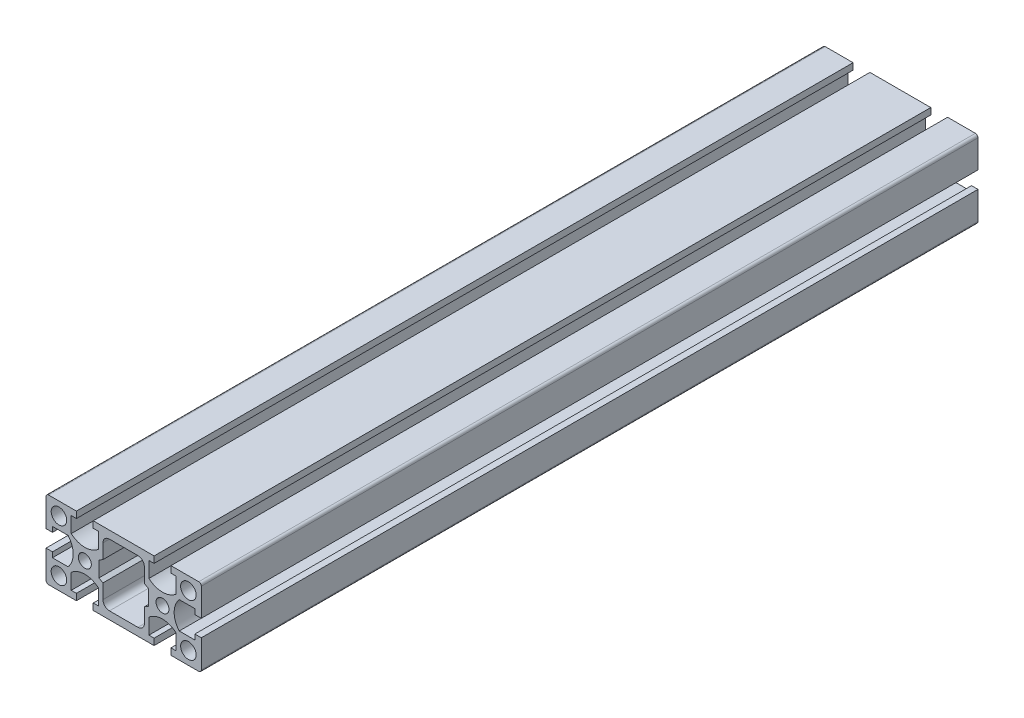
ISO-10303-21;
HEADER;
FILE_DESCRIPTION(('STEP AP214'),'2;1');
FILE_NAME('part.step','',(''),(''),'','','');
FILE_SCHEMA(('AUTOMOTIVE_DESIGN { 1 0 10303 214 1 1 1 1 }'));
ENDSEC;
DATA;
#1=APPLICATION_CONTEXT('core data for automotive mechanical design processes');
#2=APPLICATION_PROTOCOL_DEFINITION('international standard','automotive_design',2000,#1);
#3=PRODUCT_CONTEXT('',#1,'mechanical');
#4=PRODUCT('Part','Part','',(#3));
#5=PRODUCT_RELATED_PRODUCT_CATEGORY('part','',(#4));
#6=PRODUCT_DEFINITION_FORMATION('','',#4);
#7=PRODUCT_DEFINITION_CONTEXT('part definition',#1,'design');
#8=PRODUCT_DEFINITION('design','',#6,#7);
#9=PRODUCT_DEFINITION_SHAPE('','',#8);
#10=(LENGTH_UNIT() NAMED_UNIT(*) SI_UNIT(.MILLI.,.METRE.));
#11=(NAMED_UNIT(*) PLANE_ANGLE_UNIT() SI_UNIT($,.RADIAN.));
#12=(NAMED_UNIT(*) SI_UNIT($,.STERADIAN.) SOLID_ANGLE_UNIT());
#13=UNCERTAINTY_MEASURE_WITH_UNIT(LENGTH_MEASURE(1.E-05),#10,'distance_accuracy_value','');
#14=(GEOMETRIC_REPRESENTATION_CONTEXT(3) GLOBAL_UNCERTAINTY_ASSIGNED_CONTEXT((#13)) GLOBAL_UNIT_ASSIGNED_CONTEXT((#10,
#11,#12)) REPRESENTATION_CONTEXT('',''));
#15=CARTESIAN_POINT('',(0.,0.,0.));
#16=DIRECTION('',(0.,0.,1.));
#17=DIRECTION('',(1.,0.,0.));
#18=AXIS2_PLACEMENT_3D('',#15,#16,#17);
#19=CARTESIAN_POINT('',(28.9999999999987,14.,150.));
#20=DIRECTION('',(0.,0.,1.));
#21=DIRECTION('',(1.,0.,0.));
#22=AXIS2_PLACEMENT_3D('',#19,#20,#21);
#23=PLANE('',#22);
#24=CARTESIAN_POINT('',(-14.9999999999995,0.,150.));
#25=DIRECTION('',(0.,0.,1.));
#26=DIRECTION('',(1.,0.,0.));
#27=AXIS2_PLACEMENT_3D('',#24,#25,#26);
#28=CIRCLE('',#27,2.5);
#29=CARTESIAN_POINT('',(-12.4999999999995,0.,150.));
#30=VERTEX_POINT('',#29);
#31=EDGE_CURVE('E538',#30,#30,#28,.T.);
#32=ORIENTED_EDGE('',*,*,#31,.F.);
#33=EDGE_LOOP('',(#32));
#34=FACE_BOUND('',#33,.T.);
#35=CARTESIAN_POINT('',(-24.9999999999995,-9.99999999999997,150.));
#36=DIRECTION('',(0.,0.,1.));
#37=DIRECTION('',(1.,0.,0.));
#38=AXIS2_PLACEMENT_3D('',#35,#36,#37);
#39=CIRCLE('',#38,3.);
#40=CARTESIAN_POINT('',(-21.9999999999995,-9.99999999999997,150.));
#41=VERTEX_POINT('',#40);
#42=EDGE_CURVE('E610',#41,#41,#39,.T.);
#43=ORIENTED_EDGE('',*,*,#42,.F.);
#44=EDGE_LOOP('',(#43));
#45=FACE_BOUND('',#44,.T.);
#46=CARTESIAN_POINT('',(-24.9999999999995,10.,150.));
#47=DIRECTION('',(0.,0.,1.));
#48=DIRECTION('',(1.,0.,0.));
#49=AXIS2_PLACEMENT_3D('',#46,#47,#48);
#50=CIRCLE('',#49,3.);
#51=CARTESIAN_POINT('',(-21.9999999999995,10.,150.));
#52=VERTEX_POINT('',#51);
#53=EDGE_CURVE('E622',#52,#52,#50,.T.);
#54=ORIENTED_EDGE('',*,*,#53,.F.);
#55=EDGE_LOOP('',(#54));
#56=FACE_BOUND('',#55,.T.);
#57=DIRECTION('',(0.,-1.,0.));
#58=VECTOR('',#57,1.);
#59=CARTESIAN_POINT('',(27.5000000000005,5.25000000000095,150.));
#60=LINE('',#59,#58);
#61=CARTESIAN_POINT('',(27.5000000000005,5.25000000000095,150.));
#62=VERTEX_POINT('',#61);
#63=CARTESIAN_POINT('',(27.5000000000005,3.25000000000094,150.));
#64=VERTEX_POINT('',#63);
#65=EDGE_CURVE('E634',#62,#64,#60,.T.);
#66=ORIENTED_EDGE('',*,*,#65,.T.);
#67=DIRECTION('',(1.,0.,0.));
#68=VECTOR('',#67,1.);
#69=CARTESIAN_POINT('',(27.5000000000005,3.25000000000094,150.));
#70=LINE('',#69,#68);
#71=CARTESIAN_POINT('',(29.9999999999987,3.25000000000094,150.));
#72=VERTEX_POINT('',#71);
#73=EDGE_CURVE('E637',#64,#72,#70,.T.);
#74=ORIENTED_EDGE('',*,*,#73,.T.);
#75=DIRECTION('',(0.,1.,0.));
#76=VECTOR('',#75,1.);
#77=CARTESIAN_POINT('',(29.9999999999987,3.25000000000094,150.));
#78=LINE('',#77,#76);
#79=CARTESIAN_POINT('',(29.9999999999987,14.,150.));
#80=VERTEX_POINT('',#79);
#81=EDGE_CURVE('E640',#72,#80,#78,.T.);
#82=ORIENTED_EDGE('',*,*,#81,.T.);
#83=CARTESIAN_POINT('',(28.9999999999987,14.,150.));
#84=DIRECTION('',(0.,0.,1.));
#85=DIRECTION('',(1.,0.,0.));
#86=AXIS2_PLACEMENT_3D('',#83,#84,#85);
#87=CIRCLE('',#86,0.999999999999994);
#88=CARTESIAN_POINT('',(28.9999999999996,15.,150.));
#89=VERTEX_POINT('',#88);
#90=EDGE_CURVE('E642',#80,#89,#87,.T.);
#91=ORIENTED_EDGE('',*,*,#90,.T.);
#92=DIRECTION('',(-1.,0.,0.));
#93=VECTOR('',#92,1.);
#94=CARTESIAN_POINT('',(28.9999999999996,15.,150.));
#95=LINE('',#94,#93);
#96=CARTESIAN_POINT('',(18.2499999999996,15.,150.));
#97=VERTEX_POINT('',#96);
#98=EDGE_CURVE('E644',#89,#97,#95,.T.);
#99=ORIENTED_EDGE('',*,*,#98,.T.);
#100=DIRECTION('',(0.,-1.,0.));
#101=VECTOR('',#100,1.);
#102=CARTESIAN_POINT('',(18.2499999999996,15.,150.));
#103=LINE('',#102,#101);
#104=CARTESIAN_POINT('',(18.2499999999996,12.5,150.));
#105=VERTEX_POINT('',#104);
#106=EDGE_CURVE('E646',#97,#105,#103,.T.);
#107=ORIENTED_EDGE('',*,*,#106,.T.);
#108=DIRECTION('',(1.,0.,0.));
#109=VECTOR('',#108,1.);
#110=CARTESIAN_POINT('',(18.2499999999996,12.5,150.));
#111=LINE('',#110,#109);
#112=CARTESIAN_POINT('',(20.2499999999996,12.5,150.));
#113=VERTEX_POINT('',#112);
#114=EDGE_CURVE('E648',#105,#113,#111,.T.);
#115=ORIENTED_EDGE('',*,*,#114,.T.);
#116=DIRECTION('',(0.,-1.,0.));
#117=VECTOR('',#116,1.);
#118=CARTESIAN_POINT('',(20.2499999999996,12.5,150.));
#119=LINE('',#118,#117);
#120=CARTESIAN_POINT('',(20.2499999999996,6.46365176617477,150.));
#121=VERTEX_POINT('',#120);
#122=EDGE_CURVE('E650',#113,#121,#119,.T.);
#123=ORIENTED_EDGE('',*,*,#122,.T.);
#124=CARTESIAN_POINT('',(15.0000000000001,12.4999999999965,150.));
#125=DIRECTION('',(0.,0.,-1.));
#126=DIRECTION('',(1.,0.,0.));
#127=AXIS2_PLACEMENT_3D('',#124,#125,#126);
#128=CIRCLE('',#127,7.99999999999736);
#129=CARTESIAN_POINT('',(9.75000000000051,6.46365176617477,150.));
#130=VERTEX_POINT('',#129);
#131=EDGE_CURVE('E652',#121,#130,#128,.T.);
#132=ORIENTED_EDGE('',*,*,#131,.T.);
#133=DIRECTION('',(0.,1.,0.));
#134=VECTOR('',#133,1.);
#135=CARTESIAN_POINT('',(9.75000000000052,6.46365176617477,150.));
#136=LINE('',#135,#134);
#137=CARTESIAN_POINT('',(9.75000000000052,12.5,150.));
#138=VERTEX_POINT('',#137);
#139=EDGE_CURVE('E654',#130,#138,#136,.T.);
#140=ORIENTED_EDGE('',*,*,#139,.T.);
#141=DIRECTION('',(1.,0.,0.));
#142=VECTOR('',#141,1.);
#143=CARTESIAN_POINT('',(9.75000000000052,12.5,150.));
#144=LINE('',#143,#142);
#145=CARTESIAN_POINT('',(11.7500000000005,12.5,150.));
#146=VERTEX_POINT('',#145);
#147=EDGE_CURVE('E656',#138,#146,#144,.T.);
#148=ORIENTED_EDGE('',*,*,#147,.T.);
#149=DIRECTION('',(0.,1.,0.));
#150=VECTOR('',#149,1.);
#151=CARTESIAN_POINT('',(11.7500000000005,12.5,150.));
#152=LINE('',#151,#150);
#153=CARTESIAN_POINT('',(11.7500000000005,15.,150.));
#154=VERTEX_POINT('',#153);
#155=EDGE_CURVE('E658',#146,#154,#152,.T.);
#156=ORIENTED_EDGE('',*,*,#155,.T.);
#157=DIRECTION('',(-1.,0.,0.));
#158=VECTOR('',#157,1.);
#159=CARTESIAN_POINT('',(11.7500000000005,15.,150.));
#160=LINE('',#159,#158);
#161=CARTESIAN_POINT('',(-11.7499999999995,15.,150.));
#162=VERTEX_POINT('',#161);
#163=EDGE_CURVE('E660',#154,#162,#160,.T.);
#164=ORIENTED_EDGE('',*,*,#163,.T.);
#165=DIRECTION('',(0.,-1.,0.));
#166=VECTOR('',#165,1.);
#167=CARTESIAN_POINT('',(-11.7499999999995,15.,150.));
#168=LINE('',#167,#166);
#169=CARTESIAN_POINT('',(-11.7499999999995,12.5,150.));
#170=VERTEX_POINT('',#169);
#171=EDGE_CURVE('E662',#162,#170,#168,.T.);
#172=ORIENTED_EDGE('',*,*,#171,.T.);
#173=DIRECTION('',(1.,0.,0.));
#174=VECTOR('',#173,1.);
#175=CARTESIAN_POINT('',(-11.7499999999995,12.5,150.));
#176=LINE('',#175,#174);
#177=CARTESIAN_POINT('',(-9.74999999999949,12.5,150.));
#178=VERTEX_POINT('',#177);
#179=EDGE_CURVE('E664',#170,#178,#176,.T.);
#180=ORIENTED_EDGE('',*,*,#179,.T.);
#181=DIRECTION('',(0.,-1.,0.));
#182=VECTOR('',#181,1.);
#183=CARTESIAN_POINT('',(-9.74999999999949,12.5,150.));
#184=LINE('',#183,#182);
#185=CARTESIAN_POINT('',(-9.74999999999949,6.46365176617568,150.));
#186=VERTEX_POINT('',#185);
#187=EDGE_CURVE('E666',#178,#186,#184,.T.);
#188=ORIENTED_EDGE('',*,*,#187,.T.);
#189=CARTESIAN_POINT('',(-14.9999999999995,12.4999999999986,150.));
#190=DIRECTION('',(0.,0.,-1.));
#191=DIRECTION('',(1.,0.,0.));
#192=AXIS2_PLACEMENT_3D('',#189,#190,#191);
#193=CIRCLE('',#192,7.99999999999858);
#194=CARTESIAN_POINT('',(-20.2499999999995,6.46365176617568,150.));
#195=VERTEX_POINT('',#194);
#196=EDGE_CURVE('E668',#186,#195,#193,.T.);
#197=ORIENTED_EDGE('',*,*,#196,.T.);
#198=DIRECTION('',(0.,1.,0.));
#199=VECTOR('',#198,1.);
#200=CARTESIAN_POINT('',(-20.2499999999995,6.46365176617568,150.));
#201=LINE('',#200,#199);
#202=CARTESIAN_POINT('',(-20.2499999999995,12.5,150.));
#203=VERTEX_POINT('',#202);
#204=EDGE_CURVE('E670',#195,#203,#201,.T.);
#205=ORIENTED_EDGE('',*,*,#204,.T.);
#206=DIRECTION('',(1.,0.,0.));
#207=VECTOR('',#206,1.);
#208=CARTESIAN_POINT('',(-20.2499999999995,12.5,150.));
#209=LINE('',#208,#207);
#210=CARTESIAN_POINT('',(-18.2499999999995,12.5,150.));
#211=VERTEX_POINT('',#210);
#212=EDGE_CURVE('E672',#203,#211,#209,.T.);
#213=ORIENTED_EDGE('',*,*,#212,.T.);
#214=DIRECTION('',(0.,1.,0.));
#215=VECTOR('',#214,1.);
#216=CARTESIAN_POINT('',(-18.2499999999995,12.5,150.));
#217=LINE('',#216,#215);
#218=CARTESIAN_POINT('',(-18.2499999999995,15.,150.));
#219=VERTEX_POINT('',#218);
#220=EDGE_CURVE('E674',#211,#219,#217,.T.);
#221=ORIENTED_EDGE('',*,*,#220,.T.);
#222=DIRECTION('',(-1.,0.,0.));
#223=VECTOR('',#222,1.);
#224=CARTESIAN_POINT('',(-18.2499999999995,15.,150.));
#225=LINE('',#224,#223);
#226=CARTESIAN_POINT('',(-28.9999999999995,15.,150.));
#227=VERTEX_POINT('',#226);
#228=EDGE_CURVE('E676',#219,#227,#225,.T.);
#229=ORIENTED_EDGE('',*,*,#228,.T.);
#230=CARTESIAN_POINT('',(-28.9999999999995,14.,150.));
#231=DIRECTION('',(0.,0.,1.));
#232=DIRECTION('',(1.,0.,0.));
#233=AXIS2_PLACEMENT_3D('',#230,#231,#232);
#234=CIRCLE('',#233,1.);
#235=CARTESIAN_POINT('',(-29.9999999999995,14.,150.));
#236=VERTEX_POINT('',#235);
#237=EDGE_CURVE('E678',#227,#236,#234,.T.);
#238=ORIENTED_EDGE('',*,*,#237,.T.);
#239=DIRECTION('',(0.,-1.,0.));
#240=VECTOR('',#239,1.);
#241=CARTESIAN_POINT('',(-29.9999999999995,14.,150.));
#242=LINE('',#241,#240);
#243=CARTESIAN_POINT('',(-29.9999999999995,3.25000000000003,150.));
#244=VERTEX_POINT('',#243);
#245=EDGE_CURVE('E680',#236,#244,#242,.T.);
#246=ORIENTED_EDGE('',*,*,#245,.T.);
#247=DIRECTION('',(1.,0.,0.));
#248=VECTOR('',#247,1.);
#249=CARTESIAN_POINT('',(-29.9999999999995,3.25000000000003,150.));
#250=LINE('',#249,#248);
#251=CARTESIAN_POINT('',(-27.4999999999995,3.25000000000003,150.));
#252=VERTEX_POINT('',#251);
#253=EDGE_CURVE('E682',#244,#252,#250,.T.);
#254=ORIENTED_EDGE('',*,*,#253,.T.);
#255=DIRECTION('',(0.,1.,0.));
#256=VECTOR('',#255,1.);
#257=CARTESIAN_POINT('',(-27.4999999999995,3.25000000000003,150.));
#258=LINE('',#257,#256);
#259=CARTESIAN_POINT('',(-27.4999999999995,5.25000000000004,150.));
#260=VERTEX_POINT('',#259);
#261=EDGE_CURVE('E684',#252,#260,#258,.T.);
#262=ORIENTED_EDGE('',*,*,#261,.T.);
#263=DIRECTION('',(1.,0.,0.));
#264=VECTOR('',#263,1.);
#265=CARTESIAN_POINT('',(-27.4999999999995,5.25000000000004,150.));
#266=LINE('',#265,#264);
#267=CARTESIAN_POINT('',(-21.4636517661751,5.25000000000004,150.));
#268=VERTEX_POINT('',#267);
#269=EDGE_CURVE('E686',#260,#268,#266,.T.);
#270=ORIENTED_EDGE('',*,*,#269,.T.);
#271=CARTESIAN_POINT('',(-27.4999999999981,0.,150.));
#272=DIRECTION('',(0.,0.,-1.));
#273=DIRECTION('',(1.,0.,0.));
#274=AXIS2_PLACEMENT_3D('',#271,#272,#273);
#275=CIRCLE('',#274,7.99999999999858);
#276=CARTESIAN_POINT('',(-21.4636517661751,-5.24999999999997,150.));
#277=VERTEX_POINT('',#276);
#278=EDGE_CURVE('E688',#268,#277,#275,.T.);
#279=ORIENTED_EDGE('',*,*,#278,.T.);
#280=DIRECTION('',(-1.,0.,0.));
#281=VECTOR('',#280,1.);
#282=CARTESIAN_POINT('',(-21.4636517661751,-5.24999999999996,150.));
#283=LINE('',#282,#281);
#284=CARTESIAN_POINT('',(-27.4999999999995,-5.24999999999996,150.));
#285=VERTEX_POINT('',#284);
#286=EDGE_CURVE('E690',#277,#285,#283,.T.);
#287=ORIENTED_EDGE('',*,*,#286,.T.);
#288=DIRECTION('',(0.,1.,0.));
#289=VECTOR('',#288,1.);
#290=CARTESIAN_POINT('',(-27.4999999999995,-5.24999999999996,150.));
#291=LINE('',#290,#289);
#292=CARTESIAN_POINT('',(-27.4999999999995,-3.24999999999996,150.));
#293=VERTEX_POINT('',#292);
#294=EDGE_CURVE('E692',#285,#293,#291,.T.);
#295=ORIENTED_EDGE('',*,*,#294,.T.);
#296=DIRECTION('',(-1.,0.,0.));
#297=VECTOR('',#296,1.);
#298=CARTESIAN_POINT('',(-27.4999999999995,-3.24999999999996,150.));
#299=LINE('',#298,#297);
#300=CARTESIAN_POINT('',(-29.9999999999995,-3.24999999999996,150.));
#301=VERTEX_POINT('',#300);
#302=EDGE_CURVE('E694',#293,#301,#299,.T.);
#303=ORIENTED_EDGE('',*,*,#302,.T.);
#304=DIRECTION('',(0.,-1.,0.));
#305=VECTOR('',#304,1.);
#306=CARTESIAN_POINT('',(-29.9999999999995,-3.24999999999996,150.));
#307=LINE('',#306,#305);
#308=CARTESIAN_POINT('',(-29.9999999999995,-14.,150.));
#309=VERTEX_POINT('',#308);
#310=EDGE_CURVE('E696',#301,#309,#307,.T.);
#311=ORIENTED_EDGE('',*,*,#310,.T.);
#312=CARTESIAN_POINT('',(-28.9999999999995,-14.,150.));
#313=DIRECTION('',(0.,0.,1.));
#314=DIRECTION('',(1.,0.,0.));
#315=AXIS2_PLACEMENT_3D('',#312,#313,#314);
#316=CIRCLE('',#315,1.);
#317=CARTESIAN_POINT('',(-28.9999999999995,-15.,150.));
#318=VERTEX_POINT('',#317);
#319=EDGE_CURVE('E698',#309,#318,#316,.T.);
#320=ORIENTED_EDGE('',*,*,#319,.T.);
#321=DIRECTION('',(1.,0.,0.));
#322=VECTOR('',#321,1.);
#323=CARTESIAN_POINT('',(-28.9999999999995,-15.,150.));
#324=LINE('',#323,#322);
#325=CARTESIAN_POINT('',(-18.2499999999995,-15.,150.));
#326=VERTEX_POINT('',#325);
#327=EDGE_CURVE('E700',#318,#326,#324,.T.);
#328=ORIENTED_EDGE('',*,*,#327,.T.);
#329=DIRECTION('',(0.,1.,0.));
#330=VECTOR('',#329,1.);
#331=CARTESIAN_POINT('',(-18.2499999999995,-15.,150.));
#332=LINE('',#331,#330);
#333=CARTESIAN_POINT('',(-18.2499999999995,-12.5,150.));
#334=VERTEX_POINT('',#333);
#335=EDGE_CURVE('E702',#326,#334,#332,.T.);
#336=ORIENTED_EDGE('',*,*,#335,.T.);
#337=DIRECTION('',(-1.,0.,0.));
#338=VECTOR('',#337,1.);
#339=CARTESIAN_POINT('',(-18.2499999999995,-12.5,150.));
#340=LINE('',#339,#338);
#341=CARTESIAN_POINT('',(-20.2499999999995,-12.5,150.));
#342=VERTEX_POINT('',#341);
#343=EDGE_CURVE('E704',#334,#342,#340,.T.);
#344=ORIENTED_EDGE('',*,*,#343,.T.);
#345=DIRECTION('',(0.,1.,0.));
#346=VECTOR('',#345,1.);
#347=CARTESIAN_POINT('',(-20.2499999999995,-12.5,150.));
#348=LINE('',#347,#346);
#349=CARTESIAN_POINT('',(-20.2499999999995,-6.4636517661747,150.));
#350=VERTEX_POINT('',#349);
#351=EDGE_CURVE('E706',#342,#350,#348,.T.);
#352=ORIENTED_EDGE('',*,*,#351,.T.);
#353=CARTESIAN_POINT('',(-14.9999999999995,-12.5000000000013,150.));
#354=DIRECTION('',(0.,0.,-1.));
#355=DIRECTION('',(1.,0.,0.));
#356=AXIS2_PLACEMENT_3D('',#353,#354,#355);
#357=CIRCLE('',#356,8.00000000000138);
#358=CARTESIAN_POINT('',(-9.74999999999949,-6.4636517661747,150.));
#359=VERTEX_POINT('',#358);
#360=EDGE_CURVE('E708',#350,#359,#357,.T.);
#361=ORIENTED_EDGE('',*,*,#360,.T.);
#362=DIRECTION('',(0.,-1.,0.));
#363=VECTOR('',#362,1.);
#364=CARTESIAN_POINT('',(-9.74999999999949,-6.4636517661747,150.));
#365=LINE('',#364,#363);
#366=CARTESIAN_POINT('',(-9.74999999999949,-12.5,150.));
#367=VERTEX_POINT('',#366);
#368=EDGE_CURVE('E710',#359,#367,#365,.T.);
#369=ORIENTED_EDGE('',*,*,#368,.T.);
#370=DIRECTION('',(-1.,0.,0.));
#371=VECTOR('',#370,1.);
#372=CARTESIAN_POINT('',(-9.74999999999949,-12.5,150.));
#373=LINE('',#372,#371);
#374=CARTESIAN_POINT('',(-11.7499999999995,-12.5,150.));
#375=VERTEX_POINT('',#374);
#376=EDGE_CURVE('E712',#367,#375,#373,.T.);
#377=ORIENTED_EDGE('',*,*,#376,.T.);
#378=DIRECTION('',(0.,-1.,0.));
#379=VECTOR('',#378,1.);
#380=CARTESIAN_POINT('',(-11.7499999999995,-12.5,150.));
#381=LINE('',#380,#379);
#382=CARTESIAN_POINT('',(-11.7499999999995,-15.,150.));
#383=VERTEX_POINT('',#382);
#384=EDGE_CURVE('E714',#375,#383,#381,.T.);
#385=ORIENTED_EDGE('',*,*,#384,.T.);
#386=DIRECTION('',(1.,0.,0.));
#387=VECTOR('',#386,1.);
#388=CARTESIAN_POINT('',(-11.7499999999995,-15.,150.));
#389=LINE('',#388,#387);
#390=CARTESIAN_POINT('',(11.7500000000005,-15.,150.));
#391=VERTEX_POINT('',#390);
#392=EDGE_CURVE('E716',#383,#391,#389,.T.);
#393=ORIENTED_EDGE('',*,*,#392,.T.);
#394=DIRECTION('',(0.,1.,0.));
#395=VECTOR('',#394,1.);
#396=CARTESIAN_POINT('',(11.7500000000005,-15.,150.));
#397=LINE('',#396,#395);
#398=CARTESIAN_POINT('',(11.7500000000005,-12.5,150.));
#399=VERTEX_POINT('',#398);
#400=EDGE_CURVE('E718',#391,#399,#397,.T.);
#401=ORIENTED_EDGE('',*,*,#400,.T.);
#402=DIRECTION('',(-1.,0.,0.));
#403=VECTOR('',#402,1.);
#404=CARTESIAN_POINT('',(11.7500000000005,-12.5,150.));
#405=LINE('',#404,#403);
#406=CARTESIAN_POINT('',(9.75000000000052,-12.5,150.));
#407=VERTEX_POINT('',#406);
#408=EDGE_CURVE('E720',#399,#407,#405,.T.);
#409=ORIENTED_EDGE('',*,*,#408,.T.);
#410=DIRECTION('',(0.,1.,0.));
#411=VECTOR('',#410,1.);
#412=CARTESIAN_POINT('',(9.75000000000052,-12.5,150.));
#413=LINE('',#412,#411);
#414=CARTESIAN_POINT('',(9.75000000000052,-6.46365176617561,150.));
#415=VERTEX_POINT('',#414);
#416=EDGE_CURVE('E722',#407,#415,#413,.T.);
#417=ORIENTED_EDGE('',*,*,#416,.T.);
#418=CARTESIAN_POINT('',(15.0000000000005,-12.4999999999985,150.));
#419=DIRECTION('',(0.,0.,-1.));
#420=DIRECTION('',(1.,0.,0.));
#421=AXIS2_PLACEMENT_3D('',#418,#419,#420);
#422=CIRCLE('',#421,7.99999999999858);
#423=CARTESIAN_POINT('',(20.2500000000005,-6.46365176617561,150.));
#424=VERTEX_POINT('',#423);
#425=EDGE_CURVE('E724',#415,#424,#422,.T.);
#426=ORIENTED_EDGE('',*,*,#425,.T.);
#427=DIRECTION('',(0.,-1.,0.));
#428=VECTOR('',#427,1.);
#429=CARTESIAN_POINT('',(20.2500000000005,-6.46365176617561,150.));
#430=LINE('',#429,#428);
#431=CARTESIAN_POINT('',(20.2500000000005,-12.5,150.));
#432=VERTEX_POINT('',#431);
#433=EDGE_CURVE('E726',#424,#432,#430,.T.);
#434=ORIENTED_EDGE('',*,*,#433,.T.);
#435=DIRECTION('',(-1.,0.,0.));
#436=VECTOR('',#435,1.);
#437=CARTESIAN_POINT('',(20.2500000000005,-12.5,150.));
#438=LINE('',#437,#436);
#439=CARTESIAN_POINT('',(18.2500000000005,-12.5,150.));
#440=VERTEX_POINT('',#439);
#441=EDGE_CURVE('E728',#432,#440,#438,.T.);
#442=ORIENTED_EDGE('',*,*,#441,.T.);
#443=DIRECTION('',(0.,-1.,0.));
#444=VECTOR('',#443,1.);
#445=CARTESIAN_POINT('',(18.2500000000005,-12.5,150.));
#446=LINE('',#445,#444);
#447=CARTESIAN_POINT('',(18.2500000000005,-15.,150.));
#448=VERTEX_POINT('',#447);
#449=EDGE_CURVE('E730',#440,#448,#446,.T.);
#450=ORIENTED_EDGE('',*,*,#449,.T.);
#451=DIRECTION('',(1.,0.,0.));
#452=VECTOR('',#451,1.);
#453=CARTESIAN_POINT('',(18.2500000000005,-15.,150.));
#454=LINE('',#453,#452);
#455=CARTESIAN_POINT('',(29.0000000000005,-15.,150.));
#456=VERTEX_POINT('',#455);
#457=EDGE_CURVE('E732',#448,#456,#454,.T.);
#458=ORIENTED_EDGE('',*,*,#457,.T.);
#459=CARTESIAN_POINT('',(29.0000000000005,-14.,150.));
#460=DIRECTION('',(0.,0.,1.));
#461=DIRECTION('',(1.,0.,0.));
#462=AXIS2_PLACEMENT_3D('',#459,#460,#461);
#463=CIRCLE('',#462,1.00000000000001);
#464=CARTESIAN_POINT('',(30.0000000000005,-14.,150.));
#465=VERTEX_POINT('',#464);
#466=EDGE_CURVE('E734',#456,#465,#463,.T.);
#467=ORIENTED_EDGE('',*,*,#466,.T.);
#468=DIRECTION('',(0.,1.,0.));
#469=VECTOR('',#468,1.);
#470=CARTESIAN_POINT('',(30.0000000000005,-14.,150.));
#471=LINE('',#470,#469);
#472=CARTESIAN_POINT('',(30.0000000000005,-3.24999999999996,150.));
#473=VERTEX_POINT('',#472);
#474=EDGE_CURVE('E736',#465,#473,#471,.T.);
#475=ORIENTED_EDGE('',*,*,#474,.T.);
#476=DIRECTION('',(-1.,0.,0.));
#477=VECTOR('',#476,1.);
#478=CARTESIAN_POINT('',(30.0000000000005,-3.24999999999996,150.));
#479=LINE('',#478,#477);
#480=CARTESIAN_POINT('',(27.5000000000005,-3.24999999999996,150.));
#481=VERTEX_POINT('',#480);
#482=EDGE_CURVE('E738',#473,#481,#479,.T.);
#483=ORIENTED_EDGE('',*,*,#482,.T.);
#484=DIRECTION('',(0.,-1.,0.));
#485=VECTOR('',#484,1.);
#486=CARTESIAN_POINT('',(27.5000000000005,-3.24999999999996,150.));
#487=LINE('',#486,#485);
#488=CARTESIAN_POINT('',(27.5000000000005,-5.24999999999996,150.));
#489=VERTEX_POINT('',#488);
#490=EDGE_CURVE('E740',#481,#489,#487,.T.);
#491=ORIENTED_EDGE('',*,*,#490,.T.);
#492=DIRECTION('',(-1.,0.,0.));
#493=VECTOR('',#492,1.);
#494=CARTESIAN_POINT('',(27.5000000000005,-5.24999999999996,150.));
#495=LINE('',#494,#493);
#496=CARTESIAN_POINT('',(21.4636517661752,-5.24999999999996,150.));
#497=VERTEX_POINT('',#496);
#498=EDGE_CURVE('E742',#489,#497,#495,.T.);
#499=ORIENTED_EDGE('',*,*,#498,.T.);
#500=CARTESIAN_POINT('',(27.4999999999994,4.8919202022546E-13,150.));
#501=DIRECTION('',(0.,0.,-1.));
#502=DIRECTION('',(1.,0.,0.));
#503=AXIS2_PLACEMENT_3D('',#500,#501,#502);
#504=CIRCLE('',#503,7.9999999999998);
#505=CARTESIAN_POINT('',(21.4636517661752,5.25000000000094,150.));
#506=VERTEX_POINT('',#505);
#507=EDGE_CURVE('E744',#497,#506,#504,.T.);
#508=ORIENTED_EDGE('',*,*,#507,.T.);
#509=DIRECTION('',(1.,0.,0.));
#510=VECTOR('',#509,1.);
#511=CARTESIAN_POINT('',(21.4636517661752,5.25000000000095,150.));
#512=LINE('',#511,#510);
#513=EDGE_CURVE('E746',#506,#62,#512,.T.);
#514=ORIENTED_EDGE('',*,*,#513,.T.);
#515=EDGE_LOOP('',(#66,#74,#82,#91,#99,#107,#115,#123,#132,#140,#148,#156,#164,#172,#180,#188,
#197,#205,#213,#221,#229,#238,#246,#254,#262,#270,#279,#287,#295,#303,#311,#320,#328,#336,#344,
#352,#361,#369,#377,#385,#393,#401,#409,#417,#426,#434,#442,#450,#458,#467,#475,#483,#491,#499,
#508,#514));
#516=FACE_BOUND('',#515,.T.);
#517=CARTESIAN_POINT('',(24.9999999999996,10.0000000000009,150.));
#518=DIRECTION('',(0.,0.,1.));
#519=DIRECTION('',(1.,0.,0.));
#520=AXIS2_PLACEMENT_3D('',#517,#518,#519);
#521=CIRCLE('',#520,3.);
#522=CARTESIAN_POINT('',(27.9999999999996,10.0000000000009,150.));
#523=VERTEX_POINT('',#522);
#524=EDGE_CURVE('E628',#523,#523,#521,.T.);
#525=ORIENTED_EDGE('',*,*,#524,.F.);
#526=EDGE_LOOP('',(#525));
#527=FACE_BOUND('',#526,.T.);
#528=CARTESIAN_POINT('',(25.0000000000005,-9.99999999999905,150.));
#529=DIRECTION('',(0.,0.,1.));
#530=DIRECTION('',(1.,0.,0.));
#531=AXIS2_PLACEMENT_3D('',#528,#529,#530);
#532=CIRCLE('',#531,3.);
#533=CARTESIAN_POINT('',(28.0000000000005,-9.99999999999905,150.));
#534=VERTEX_POINT('',#533);
#535=EDGE_CURVE('E616',#534,#534,#532,.T.);
#536=ORIENTED_EDGE('',*,*,#535,.F.);
#537=EDGE_LOOP('',(#536));
#538=FACE_BOUND('',#537,.T.);
#539=DIRECTION('',(0.,1.,0.));
#540=VECTOR('',#539,1.);
#541=CARTESIAN_POINT('',(9.55000000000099,-3.00000000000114,150.));
#542=LINE('',#541,#540);
#543=CARTESIAN_POINT('',(9.55000000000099,-3.00000000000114,150.));
#544=VERTEX_POINT('',#543);
#545=CARTESIAN_POINT('',(9.55000000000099,2.99999999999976,150.));
#546=VERTEX_POINT('',#545);
#547=EDGE_CURVE('E492',#544,#546,#542,.T.);
#548=ORIENTED_EDGE('',*,*,#547,.F.);
#549=DIRECTION('',(0.866025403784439,0.499999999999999,0.));
#550=VECTOR('',#549,1.);
#551=CARTESIAN_POINT('',(8.00000000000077,-3.89489291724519,150.));
#552=LINE('',#551,#550);
#553=CARTESIAN_POINT('',(8.00000000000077,-3.89489291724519,150.));
#554=VERTEX_POINT('',#553);
#555=EDGE_CURVE('E484',#554,#544,#552,.T.);
#556=ORIENTED_EDGE('',*,*,#555,.F.);
#557=DIRECTION('',(0.,1.,0.));
#558=VECTOR('',#557,1.);
#559=CARTESIAN_POINT('',(8.00000000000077,-9.49999999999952,150.));
#560=LINE('',#559,#558);
#561=CARTESIAN_POINT('',(8.00000000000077,-9.49999999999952,150.));
#562=VERTEX_POINT('',#561);
#563=EDGE_CURVE('E535',#562,#554,#560,.T.);
#564=ORIENTED_EDGE('',*,*,#563,.F.);
#565=CARTESIAN_POINT('',(5.50000000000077,-9.49999999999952,150.));
#566=DIRECTION('',(0.,0.,1.));
#567=DIRECTION('',(1.,0.,0.));
#568=AXIS2_PLACEMENT_3D('',#565,#566,#567);
#569=CIRCLE('',#568,2.5);
#570=CARTESIAN_POINT('',(5.50000000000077,-11.9999999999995,150.));
#571=VERTEX_POINT('',#570);
#572=EDGE_CURVE('E533',#571,#562,#569,.T.);
#573=ORIENTED_EDGE('',*,*,#572,.F.);
#574=DIRECTION('',(1.,0.,0.));
#575=VECTOR('',#574,1.);
#576=CARTESIAN_POINT('',(-5.49999999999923,-11.9999999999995,150.));
#577=LINE('',#576,#575);
#578=CARTESIAN_POINT('',(-5.49999999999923,-11.9999999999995,150.));
#579=VERTEX_POINT('',#578);
#580=EDGE_CURVE('E531',#579,#571,#577,.T.);
#581=ORIENTED_EDGE('',*,*,#580,.F.);
#582=CARTESIAN_POINT('',(-5.49999999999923,-9.49999999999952,150.));
#583=DIRECTION('',(0.,0.,1.));
#584=DIRECTION('',(1.,0.,0.));
#585=AXIS2_PLACEMENT_3D('',#582,#583,#584);
#586=CIRCLE('',#585,2.5);
#587=CARTESIAN_POINT('',(-7.99999999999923,-9.49999999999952,150.));
#588=VERTEX_POINT('',#587);
#589=EDGE_CURVE('E529',#588,#579,#586,.T.);
#590=ORIENTED_EDGE('',*,*,#589,.F.);
#591=DIRECTION('',(0.,-1.,0.));
#592=VECTOR('',#591,1.);
#593=CARTESIAN_POINT('',(-7.99999999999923,-3.89489291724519,150.));
#594=LINE('',#593,#592);
#595=CARTESIAN_POINT('',(-7.99999999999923,-3.89489291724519,150.));
#596=VERTEX_POINT('',#595);
#597=EDGE_CURVE('E527',#596,#588,#594,.T.);
#598=ORIENTED_EDGE('',*,*,#597,.F.);
#599=DIRECTION('',(0.866025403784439,-0.5,0.));
#600=VECTOR('',#599,1.);
#601=CARTESIAN_POINT('',(-9.55000000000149,-2.99999999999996,150.));
#602=LINE('',#601,#600);
#603=CARTESIAN_POINT('',(-9.55000000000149,-2.99999999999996,150.));
#604=VERTEX_POINT('',#603);
#605=EDGE_CURVE('E525',#604,#596,#602,.T.);
#606=ORIENTED_EDGE('',*,*,#605,.F.);
#607=DIRECTION('',(0.,-1.,0.));
#608=VECTOR('',#607,1.);
#609=CARTESIAN_POINT('',(-9.55000000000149,3.00000000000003,150.));
#610=LINE('',#609,#608);
#611=CARTESIAN_POINT('',(-9.55000000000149,3.00000000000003,150.));
#612=VERTEX_POINT('',#611);
#613=EDGE_CURVE('E523',#612,#604,#610,.T.);
#614=ORIENTED_EDGE('',*,*,#613,.F.);
#615=DIRECTION('',(-0.866025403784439,-0.5,0.));
#616=VECTOR('',#615,1.);
#617=CARTESIAN_POINT('',(-8.00000000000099,3.89489291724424,150.));
#618=LINE('',#617,#616);
#619=CARTESIAN_POINT('',(-8.00000000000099,3.89489291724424,150.));
#620=VERTEX_POINT('',#619);
#621=EDGE_CURVE('E521',#620,#612,#618,.T.);
#622=ORIENTED_EDGE('',*,*,#621,.F.);
#623=DIRECTION('',(0.,-1.,0.));
#624=VECTOR('',#623,1.);
#625=CARTESIAN_POINT('',(-8.00000000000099,9.49999999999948,150.));
#626=LINE('',#625,#624);
#627=CARTESIAN_POINT('',(-8.00000000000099,9.49999999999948,150.));
#628=VERTEX_POINT('',#627);
#629=EDGE_CURVE('E519',#628,#620,#626,.T.);
#630=ORIENTED_EDGE('',*,*,#629,.F.);
#631=CARTESIAN_POINT('',(-5.50000000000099,9.49999999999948,150.));
#632=DIRECTION('',(0.,0.,1.));
#633=DIRECTION('',(1.,0.,0.));
#634=AXIS2_PLACEMENT_3D('',#631,#632,#633);
#635=CIRCLE('',#634,2.5);
#636=CARTESIAN_POINT('',(-5.50000000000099,11.9999999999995,150.));
#637=VERTEX_POINT('',#636);
#638=EDGE_CURVE('E517',#637,#628,#635,.T.);
#639=ORIENTED_EDGE('',*,*,#638,.F.);
#640=DIRECTION('',(-1.,0.,0.));
#641=VECTOR('',#640,1.);
#642=CARTESIAN_POINT('',(5.49999999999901,11.9999999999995,150.));
#643=LINE('',#642,#641);
#644=CARTESIAN_POINT('',(5.49999999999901,11.9999999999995,150.));
#645=VERTEX_POINT('',#644);
#646=EDGE_CURVE('E515',#645,#637,#643,.T.);
#647=ORIENTED_EDGE('',*,*,#646,.F.);
#648=CARTESIAN_POINT('',(5.50000000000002,9.49999999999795,150.));
#649=DIRECTION('',(0.,0.,1.));
#650=DIRECTION('',(1.,0.,0.));
#651=AXIS2_PLACEMENT_3D('',#648,#649,#650);
#652=CIRCLE('',#651,2.50000000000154);
#653=CARTESIAN_POINT('',(8.00000000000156,9.49999999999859,150.));
#654=VERTEX_POINT('',#653);
#655=EDGE_CURVE('E513',#654,#645,#652,.T.);
#656=ORIENTED_EDGE('',*,*,#655,.F.);
#657=DIRECTION('',(0.,1.,0.));
#658=VECTOR('',#657,1.);
#659=CARTESIAN_POINT('',(8.00000000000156,3.89489291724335,150.));
#660=LINE('',#659,#658);
#661=CARTESIAN_POINT('',(8.00000000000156,3.89489291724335,150.));
#662=VERTEX_POINT('',#661);
#663=EDGE_CURVE('E508',#662,#654,#660,.T.);
#664=ORIENTED_EDGE('',*,*,#663,.F.);
#665=DIRECTION('',(-0.866025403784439,0.5,0.));
#666=VECTOR('',#665,1.);
#667=CARTESIAN_POINT('',(9.55000000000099,2.99999999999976,150.));
#668=LINE('',#667,#666);
#669=EDGE_CURVE('E506',#546,#662,#668,.T.);
#670=ORIENTED_EDGE('',*,*,#669,.F.);
#671=EDGE_LOOP('',(#548,#556,#564,#573,#581,#590,#598,#606,#614,#622,#630,#639,#647,#656,#664,#670));
#672=FACE_BOUND('',#671,.T.);
#673=CARTESIAN_POINT('',(14.9999999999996,0.,150.));
#674=DIRECTION('',(0.,0.,1.));
#675=DIRECTION('',(1.,0.,0.));
#676=AXIS2_PLACEMENT_3D('',#673,#674,#675);
#677=CIRCLE('',#676,2.5);
#678=CARTESIAN_POINT('',(17.4999999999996,0.,150.));
#679=VERTEX_POINT('',#678);
#680=EDGE_CURVE('E1999',#679,#679,#677,.T.);
#681=ORIENTED_EDGE('',*,*,#680,.F.);
#682=EDGE_LOOP('',(#681));
#683=FACE_BOUND('',#682,.T.);
#684=ADVANCED_FACE('F35',(#34,#45,#56,#516,#527,#538,#672,#683),#23,.T.);
#685=CARTESIAN_POINT('',(28.9999999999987,14.,-150.));
#686=DIRECTION('',(0.,0.,1.));
#687=DIRECTION('',(1.,0.,0.));
#688=AXIS2_PLACEMENT_3D('',#685,#686,#687);
#689=PLANE('',#688);
#690=CARTESIAN_POINT('',(-14.9999999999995,0.,-150.));
#691=DIRECTION('',(0.,0.,1.));
#692=DIRECTION('',(1.,0.,0.));
#693=AXIS2_PLACEMENT_3D('',#690,#691,#692);
#694=CIRCLE('',#693,2.5);
#695=CARTESIAN_POINT('',(-12.4999999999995,0.,-150.));
#696=VERTEX_POINT('',#695);
#697=EDGE_CURVE('E2005',#696,#696,#694,.T.);
#698=ORIENTED_EDGE('',*,*,#697,.T.);
#699=EDGE_LOOP('',(#698));
#700=FACE_BOUND('',#699,.T.);
#701=CARTESIAN_POINT('',(-24.9999999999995,-9.99999999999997,-150.));
#702=DIRECTION('',(0.,0.,1.));
#703=DIRECTION('',(1.,0.,0.));
#704=AXIS2_PLACEMENT_3D('',#701,#702,#703);
#705=CIRCLE('',#704,3.);
#706=CARTESIAN_POINT('',(-21.9999999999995,-9.99999999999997,-150.));
#707=VERTEX_POINT('',#706);
#708=EDGE_CURVE('E500',#707,#707,#705,.T.);
#709=ORIENTED_EDGE('',*,*,#708,.T.);
#710=EDGE_LOOP('',(#709));
#711=FACE_BOUND('',#710,.T.);
#712=CARTESIAN_POINT('',(-24.9999999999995,10.,-150.));
#713=DIRECTION('',(0.,0.,1.));
#714=DIRECTION('',(1.,0.,0.));
#715=AXIS2_PLACEMENT_3D('',#712,#713,#714);
#716=CIRCLE('',#715,3.);
#717=CARTESIAN_POINT('',(-21.9999999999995,10.,-150.));
#718=VERTEX_POINT('',#717);
#719=EDGE_CURVE('E619',#718,#718,#716,.T.);
#720=ORIENTED_EDGE('',*,*,#719,.T.);
#721=EDGE_LOOP('',(#720));
#722=FACE_BOUND('',#721,.T.);
#723=DIRECTION('',(0.,-1.,0.));
#724=VECTOR('',#723,1.);
#725=CARTESIAN_POINT('',(27.5000000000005,5.25000000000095,-150.));
#726=LINE('',#725,#724);
#727=CARTESIAN_POINT('',(27.5000000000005,5.25000000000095,-150.));
#728=VERTEX_POINT('',#727);
#729=CARTESIAN_POINT('',(27.5000000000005,3.25000000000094,-150.));
#730=VERTEX_POINT('',#729);
#731=EDGE_CURVE('E631',#728,#730,#726,.T.);
#732=ORIENTED_EDGE('',*,*,#731,.F.);
#733=DIRECTION('',(1.,0.,0.));
#734=VECTOR('',#733,1.);
#735=CARTESIAN_POINT('',(21.4636517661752,5.25000000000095,-150.));
#736=LINE('',#735,#734);
#737=CARTESIAN_POINT('',(21.4636517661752,5.25000000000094,-150.));
#738=VERTEX_POINT('',#737);
#739=EDGE_CURVE('E638',#738,#728,#736,.T.);
#740=ORIENTED_EDGE('',*,*,#739,.F.);
#741=CARTESIAN_POINT('',(27.4999999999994,4.8919202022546E-13,-150.));
#742=DIRECTION('',(0.,0.,-1.));
#743=DIRECTION('',(1.,0.,0.));
#744=AXIS2_PLACEMENT_3D('',#741,#742,#743);
#745=CIRCLE('',#744,7.9999999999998);
#746=CARTESIAN_POINT('',(21.4636517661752,-5.24999999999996,-150.));
#747=VERTEX_POINT('',#746);
#748=EDGE_CURVE('E859',#747,#738,#745,.T.);
#749=ORIENTED_EDGE('',*,*,#748,.F.);
#750=DIRECTION('',(-1.,0.,0.));
#751=VECTOR('',#750,1.);
#752=CARTESIAN_POINT('',(27.5000000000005,-5.24999999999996,-150.));
#753=LINE('',#752,#751);
#754=CARTESIAN_POINT('',(27.5000000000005,-5.24999999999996,-150.));
#755=VERTEX_POINT('',#754);
#756=EDGE_CURVE('E857',#755,#747,#753,.T.);
#757=ORIENTED_EDGE('',*,*,#756,.F.);
#758=DIRECTION('',(0.,-1.,0.));
#759=VECTOR('',#758,1.);
#760=CARTESIAN_POINT('',(27.5000000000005,-3.24999999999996,-150.));
#761=LINE('',#760,#759);
#762=CARTESIAN_POINT('',(27.5000000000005,-3.24999999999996,-150.));
#763=VERTEX_POINT('',#762);
#764=EDGE_CURVE('E855',#763,#755,#761,.T.);
#765=ORIENTED_EDGE('',*,*,#764,.F.);
#766=DIRECTION('',(-1.,0.,0.));
#767=VECTOR('',#766,1.);
#768=CARTESIAN_POINT('',(30.0000000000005,-3.24999999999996,-150.));
#769=LINE('',#768,#767);
#770=CARTESIAN_POINT('',(30.0000000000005,-3.24999999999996,-150.));
#771=VERTEX_POINT('',#770);
#772=EDGE_CURVE('E853',#771,#763,#769,.T.);
#773=ORIENTED_EDGE('',*,*,#772,.F.);
#774=DIRECTION('',(0.,1.,0.));
#775=VECTOR('',#774,1.);
#776=CARTESIAN_POINT('',(30.0000000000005,-14.,-150.));
#777=LINE('',#776,#775);
#778=CARTESIAN_POINT('',(30.0000000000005,-14.,-150.));
#779=VERTEX_POINT('',#778);
#780=EDGE_CURVE('E851',#779,#771,#777,.T.);
#781=ORIENTED_EDGE('',*,*,#780,.F.);
#782=CARTESIAN_POINT('',(29.0000000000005,-14.,-150.));
#783=DIRECTION('',(0.,0.,1.));
#784=DIRECTION('',(1.,0.,0.));
#785=AXIS2_PLACEMENT_3D('',#782,#783,#784);
#786=CIRCLE('',#785,1.00000000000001);
#787=CARTESIAN_POINT('',(29.0000000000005,-15.,-150.));
#788=VERTEX_POINT('',#787);
#789=EDGE_CURVE('E849',#788,#779,#786,.T.);
#790=ORIENTED_EDGE('',*,*,#789,.F.);
#791=DIRECTION('',(1.,0.,0.));
#792=VECTOR('',#791,1.);
#793=CARTESIAN_POINT('',(18.2500000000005,-15.,-150.));
#794=LINE('',#793,#792);
#795=CARTESIAN_POINT('',(18.2500000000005,-15.,-150.));
#796=VERTEX_POINT('',#795);
#797=EDGE_CURVE('E847',#796,#788,#794,.T.);
#798=ORIENTED_EDGE('',*,*,#797,.F.);
#799=DIRECTION('',(0.,-1.,0.));
#800=VECTOR('',#799,1.);
#801=CARTESIAN_POINT('',(18.2500000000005,-12.5,-150.));
#802=LINE('',#801,#800);
#803=CARTESIAN_POINT('',(18.2500000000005,-12.5,-150.));
#804=VERTEX_POINT('',#803);
#805=EDGE_CURVE('E845',#804,#796,#802,.T.);
#806=ORIENTED_EDGE('',*,*,#805,.F.);
#807=DIRECTION('',(-1.,0.,0.));
#808=VECTOR('',#807,1.);
#809=CARTESIAN_POINT('',(20.2500000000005,-12.5,-150.));
#810=LINE('',#809,#808);
#811=CARTESIAN_POINT('',(20.2500000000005,-12.5,-150.));
#812=VERTEX_POINT('',#811);
#813=EDGE_CURVE('E843',#812,#804,#810,.T.);
#814=ORIENTED_EDGE('',*,*,#813,.F.);
#815=DIRECTION('',(0.,-1.,0.));
#816=VECTOR('',#815,1.);
#817=CARTESIAN_POINT('',(20.2500000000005,-6.46365176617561,-150.));
#818=LINE('',#817,#816);
#819=CARTESIAN_POINT('',(20.2500000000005,-6.46365176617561,-150.));
#820=VERTEX_POINT('',#819);
#821=EDGE_CURVE('E841',#820,#812,#818,.T.);
#822=ORIENTED_EDGE('',*,*,#821,.F.);
#823=CARTESIAN_POINT('',(15.0000000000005,-12.4999999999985,-150.));
#824=DIRECTION('',(0.,0.,-1.));
#825=DIRECTION('',(1.,0.,0.));
#826=AXIS2_PLACEMENT_3D('',#823,#824,#825);
#827=CIRCLE('',#826,7.99999999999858);
#828=CARTESIAN_POINT('',(9.75000000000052,-6.46365176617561,-150.));
#829=VERTEX_POINT('',#828);
#830=EDGE_CURVE('E839',#829,#820,#827,.T.);
#831=ORIENTED_EDGE('',*,*,#830,.F.);
#832=DIRECTION('',(0.,1.,0.));
#833=VECTOR('',#832,1.);
#834=CARTESIAN_POINT('',(9.75000000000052,-12.5,-150.));
#835=LINE('',#834,#833);
#836=CARTESIAN_POINT('',(9.75000000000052,-12.5,-150.));
#837=VERTEX_POINT('',#836);
#838=EDGE_CURVE('E837',#837,#829,#835,.T.);
#839=ORIENTED_EDGE('',*,*,#838,.F.);
#840=DIRECTION('',(-1.,0.,0.));
#841=VECTOR('',#840,1.);
#842=CARTESIAN_POINT('',(11.7500000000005,-12.5,-150.));
#843=LINE('',#842,#841);
#844=CARTESIAN_POINT('',(11.7500000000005,-12.5,-150.));
#845=VERTEX_POINT('',#844);
#846=EDGE_CURVE('E835',#845,#837,#843,.T.);
#847=ORIENTED_EDGE('',*,*,#846,.F.);
#848=DIRECTION('',(0.,1.,0.));
#849=VECTOR('',#848,1.);
#850=CARTESIAN_POINT('',(11.7500000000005,-15.,-150.));
#851=LINE('',#850,#849);
#852=CARTESIAN_POINT('',(11.7500000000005,-15.,-150.));
#853=VERTEX_POINT('',#852);
#854=EDGE_CURVE('E833',#853,#845,#851,.T.);
#855=ORIENTED_EDGE('',*,*,#854,.F.);
#856=DIRECTION('',(1.,0.,0.));
#857=VECTOR('',#856,1.);
#858=CARTESIAN_POINT('',(5.13478148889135E-13,-15.,-150.));
#859=LINE('',#858,#857);
#860=CARTESIAN_POINT('',(-11.7499999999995,-15.,-150.));
#861=VERTEX_POINT('',#860);
#862=EDGE_CURVE('E831',#861,#853,#859,.T.);
#863=ORIENTED_EDGE('',*,*,#862,.F.);
#864=DIRECTION('',(0.,-1.,0.));
#865=VECTOR('',#864,1.);
#866=CARTESIAN_POINT('',(-11.7499999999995,-12.5,-150.));
#867=LINE('',#866,#865);
#868=CARTESIAN_POINT('',(-11.7499999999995,-12.5,-150.));
#869=VERTEX_POINT('',#868);
#870=EDGE_CURVE('E828',#869,#861,#867,.T.);
#871=ORIENTED_EDGE('',*,*,#870,.F.);
#872=DIRECTION('',(-1.,0.,0.));
#873=VECTOR('',#872,1.);
#874=CARTESIAN_POINT('',(-9.74999999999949,-12.5,-150.));
#875=LINE('',#874,#873);
#876=CARTESIAN_POINT('',(-9.74999999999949,-12.5,-150.));
#877=VERTEX_POINT('',#876);
#878=EDGE_CURVE('E826',#877,#869,#875,.T.);
#879=ORIENTED_EDGE('',*,*,#878,.F.);
#880=DIRECTION('',(0.,-1.,0.));
#881=VECTOR('',#880,1.);
#882=CARTESIAN_POINT('',(-9.74999999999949,-6.4636517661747,-150.));
#883=LINE('',#882,#881);
#884=CARTESIAN_POINT('',(-9.74999999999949,-6.4636517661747,-150.));
#885=VERTEX_POINT('',#884);
#886=EDGE_CURVE('E824',#885,#877,#883,.T.);
#887=ORIENTED_EDGE('',*,*,#886,.F.);
#888=CARTESIAN_POINT('',(-14.9999999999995,-12.5000000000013,-150.));
#889=DIRECTION('',(0.,0.,-1.));
#890=DIRECTION('',(1.,0.,0.));
#891=AXIS2_PLACEMENT_3D('',#888,#889,#890);
#892=CIRCLE('',#891,8.00000000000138);
#893=CARTESIAN_POINT('',(-20.2499999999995,-6.4636517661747,-150.));
#894=VERTEX_POINT('',#893);
#895=EDGE_CURVE('E822',#894,#885,#892,.T.);
#896=ORIENTED_EDGE('',*,*,#895,.F.);
#897=DIRECTION('',(0.,1.,0.));
#898=VECTOR('',#897,1.);
#899=CARTESIAN_POINT('',(-20.2499999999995,-12.5,-150.));
#900=LINE('',#899,#898);
#901=CARTESIAN_POINT('',(-20.2499999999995,-12.5,-150.));
#902=VERTEX_POINT('',#901);
#903=EDGE_CURVE('E820',#902,#894,#900,.T.);
#904=ORIENTED_EDGE('',*,*,#903,.F.);
#905=DIRECTION('',(-1.,0.,0.));
#906=VECTOR('',#905,1.);
#907=CARTESIAN_POINT('',(-18.2499999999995,-12.5,-150.));
#908=LINE('',#907,#906);
#909=CARTESIAN_POINT('',(-18.2499999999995,-12.5,-150.));
#910=VERTEX_POINT('',#909);
#911=EDGE_CURVE('E818',#910,#902,#908,.T.);
#912=ORIENTED_EDGE('',*,*,#911,.F.);
#913=DIRECTION('',(0.,1.,0.));
#914=VECTOR('',#913,1.);
#915=CARTESIAN_POINT('',(-18.2499999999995,-15.,-150.));
#916=LINE('',#915,#914);
#917=CARTESIAN_POINT('',(-18.2499999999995,-15.,-150.));
#918=VERTEX_POINT('',#917);
#919=EDGE_CURVE('E816',#918,#910,#916,.T.);
#920=ORIENTED_EDGE('',*,*,#919,.F.);
#921=DIRECTION('',(1.,0.,0.));
#922=VECTOR('',#921,1.);
#923=CARTESIAN_POINT('',(-28.9999999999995,-15.,-150.));
#924=LINE('',#923,#922);
#925=CARTESIAN_POINT('',(-28.9999999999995,-15.,-150.));
#926=VERTEX_POINT('',#925);
#927=EDGE_CURVE('E814',#926,#918,#924,.T.);
#928=ORIENTED_EDGE('',*,*,#927,.F.);
#929=CARTESIAN_POINT('',(-28.9999999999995,-14.,-150.));
#930=DIRECTION('',(0.,0.,1.));
#931=DIRECTION('',(1.,0.,0.));
#932=AXIS2_PLACEMENT_3D('',#929,#930,#931);
#933=CIRCLE('',#932,1.);
#934=CARTESIAN_POINT('',(-29.9999999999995,-14.,-150.));
#935=VERTEX_POINT('',#934);
#936=EDGE_CURVE('E812',#935,#926,#933,.T.);
#937=ORIENTED_EDGE('',*,*,#936,.F.);
#938=DIRECTION('',(0.,-1.,0.));
#939=VECTOR('',#938,1.);
#940=CARTESIAN_POINT('',(-29.9999999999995,-3.24999999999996,-150.));
#941=LINE('',#940,#939);
#942=CARTESIAN_POINT('',(-29.9999999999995,-3.24999999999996,-150.));
#943=VERTEX_POINT('',#942);
#944=EDGE_CURVE('E810',#943,#935,#941,.T.);
#945=ORIENTED_EDGE('',*,*,#944,.F.);
#946=DIRECTION('',(-1.,0.,0.));
#947=VECTOR('',#946,1.);
#948=CARTESIAN_POINT('',(-27.4999999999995,-3.24999999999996,-150.));
#949=LINE('',#948,#947);
#950=CARTESIAN_POINT('',(-27.4999999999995,-3.24999999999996,-150.));
#951=VERTEX_POINT('',#950);
#952=EDGE_CURVE('E808',#951,#943,#949,.T.);
#953=ORIENTED_EDGE('',*,*,#952,.F.);
#954=DIRECTION('',(0.,1.,0.));
#955=VECTOR('',#954,1.);
#956=CARTESIAN_POINT('',(-27.4999999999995,-5.24999999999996,-150.));
#957=LINE('',#956,#955);
#958=CARTESIAN_POINT('',(-27.4999999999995,-5.24999999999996,-150.));
#959=VERTEX_POINT('',#958);
#960=EDGE_CURVE('E806',#959,#951,#957,.T.);
#961=ORIENTED_EDGE('',*,*,#960,.F.);
#962=DIRECTION('',(-1.,0.,0.));
#963=VECTOR('',#962,1.);
#964=CARTESIAN_POINT('',(-21.4636517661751,-5.24999999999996,-150.));
#965=LINE('',#964,#963);
#966=CARTESIAN_POINT('',(-21.4636517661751,-5.24999999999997,-150.));
#967=VERTEX_POINT('',#966);
#968=EDGE_CURVE('E804',#967,#959,#965,.T.);
#969=ORIENTED_EDGE('',*,*,#968,.F.);
#970=CARTESIAN_POINT('',(-27.4999999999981,0.,-150.));
#971=DIRECTION('',(0.,0.,-1.));
#972=DIRECTION('',(1.,0.,0.));
#973=AXIS2_PLACEMENT_3D('',#970,#971,#972);
#974=CIRCLE('',#973,7.99999999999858);
#975=CARTESIAN_POINT('',(-21.4636517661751,5.25000000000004,-150.));
#976=VERTEX_POINT('',#975);
#977=EDGE_CURVE('E802',#976,#967,#974,.T.);
#978=ORIENTED_EDGE('',*,*,#977,.F.);
#979=DIRECTION('',(1.,0.,0.));
#980=VECTOR('',#979,1.);
#981=CARTESIAN_POINT('',(-27.4999999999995,5.25000000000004,-150.));
#982=LINE('',#981,#980);
#983=CARTESIAN_POINT('',(-27.4999999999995,5.25000000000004,-150.));
#984=VERTEX_POINT('',#983);
#985=EDGE_CURVE('E800',#984,#976,#982,.T.);
#986=ORIENTED_EDGE('',*,*,#985,.F.);
#987=DIRECTION('',(0.,1.,0.));
#988=VECTOR('',#987,1.);
#989=CARTESIAN_POINT('',(-27.4999999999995,3.25000000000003,-150.));
#990=LINE('',#989,#988);
#991=CARTESIAN_POINT('',(-27.4999999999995,3.25000000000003,-150.));
#992=VERTEX_POINT('',#991);
#993=EDGE_CURVE('E798',#992,#984,#990,.T.);
#994=ORIENTED_EDGE('',*,*,#993,.F.);
#995=DIRECTION('',(1.,0.,0.));
#996=VECTOR('',#995,1.);
#997=CARTESIAN_POINT('',(-29.9999999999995,3.25000000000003,-150.));
#998=LINE('',#997,#996);
#999=CARTESIAN_POINT('',(-29.9999999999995,3.25000000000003,-150.));
#1000=VERTEX_POINT('',#999);
#1001=EDGE_CURVE('E796',#1000,#992,#998,.T.);
#1002=ORIENTED_EDGE('',*,*,#1001,.F.);
#1003=DIRECTION('',(0.,-1.,0.));
#1004=VECTOR('',#1003,1.);
#1005=CARTESIAN_POINT('',(-29.9999999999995,14.,-150.));
#1006=LINE('',#1005,#1004);
#1007=CARTESIAN_POINT('',(-29.9999999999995,14.,-150.));
#1008=VERTEX_POINT('',#1007);
#1009=EDGE_CURVE('E794',#1008,#1000,#1006,.T.);
#1010=ORIENTED_EDGE('',*,*,#1009,.F.);
#1011=CARTESIAN_POINT('',(-28.9999999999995,14.,-150.));
#1012=DIRECTION('',(0.,0.,1.));
#1013=DIRECTION('',(1.,0.,0.));
#1014=AXIS2_PLACEMENT_3D('',#1011,#1012,#1013);
#1015=CIRCLE('',#1014,1.);
#1016=CARTESIAN_POINT('',(-28.9999999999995,15.,-150.));
#1017=VERTEX_POINT('',#1016);
#1018=EDGE_CURVE('E792',#1017,#1008,#1015,.T.);
#1019=ORIENTED_EDGE('',*,*,#1018,.F.);
#1020=DIRECTION('',(-1.,0.,0.));
#1021=VECTOR('',#1020,1.);
#1022=CARTESIAN_POINT('',(-18.2499999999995,15.,-150.));
#1023=LINE('',#1022,#1021);
#1024=CARTESIAN_POINT('',(-18.2499999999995,15.,-150.));
#1025=VERTEX_POINT('',#1024);
#1026=EDGE_CURVE('E790',#1025,#1017,#1023,.T.);
#1027=ORIENTED_EDGE('',*,*,#1026,.F.);
#1028=DIRECTION('',(0.,1.,0.));
#1029=VECTOR('',#1028,1.);
#1030=CARTESIAN_POINT('',(-18.2499999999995,12.5,-150.));
#1031=LINE('',#1030,#1029);
#1032=CARTESIAN_POINT('',(-18.2499999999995,12.5,-150.));
#1033=VERTEX_POINT('',#1032);
#1034=EDGE_CURVE('E788',#1033,#1025,#1031,.T.);
#1035=ORIENTED_EDGE('',*,*,#1034,.F.);
#1036=DIRECTION('',(1.,0.,0.));
#1037=VECTOR('',#1036,1.);
#1038=CARTESIAN_POINT('',(-20.2499999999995,12.5,-150.));
#1039=LINE('',#1038,#1037);
#1040=CARTESIAN_POINT('',(-20.2499999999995,12.5,-150.));
#1041=VERTEX_POINT('',#1040);
#1042=EDGE_CURVE('E786',#1041,#1033,#1039,.T.);
#1043=ORIENTED_EDGE('',*,*,#1042,.F.);
#1044=DIRECTION('',(0.,1.,0.));
#1045=VECTOR('',#1044,1.);
#1046=CARTESIAN_POINT('',(-20.2499999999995,6.46365176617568,-150.));
#1047=LINE('',#1046,#1045);
#1048=CARTESIAN_POINT('',(-20.2499999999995,6.46365176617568,-150.));
#1049=VERTEX_POINT('',#1048);
#1050=EDGE_CURVE('E784',#1049,#1041,#1047,.T.);
#1051=ORIENTED_EDGE('',*,*,#1050,.F.);
#1052=CARTESIAN_POINT('',(-14.9999999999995,12.4999999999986,-150.));
#1053=DIRECTION('',(0.,0.,-1.));
#1054=DIRECTION('',(1.,0.,0.));
#1055=AXIS2_PLACEMENT_3D('',#1052,#1053,#1054);
#1056=CIRCLE('',#1055,7.99999999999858);
#1057=CARTESIAN_POINT('',(-9.74999999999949,6.46365176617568,-150.));
#1058=VERTEX_POINT('',#1057);
#1059=EDGE_CURVE('E782',#1058,#1049,#1056,.T.);
#1060=ORIENTED_EDGE('',*,*,#1059,.F.);
#1061=DIRECTION('',(0.,-1.,0.));
#1062=VECTOR('',#1061,1.);
#1063=CARTESIAN_POINT('',(-9.74999999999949,12.5,-150.));
#1064=LINE('',#1063,#1062);
#1065=CARTESIAN_POINT('',(-9.74999999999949,12.5,-150.));
#1066=VERTEX_POINT('',#1065);
#1067=EDGE_CURVE('E780',#1066,#1058,#1064,.T.);
#1068=ORIENTED_EDGE('',*,*,#1067,.F.);
#1069=DIRECTION('',(1.,0.,0.));
#1070=VECTOR('',#1069,1.);
#1071=CARTESIAN_POINT('',(-11.7499999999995,12.5,-150.));
#1072=LINE('',#1071,#1070);
#1073=CARTESIAN_POINT('',(-11.7499999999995,12.5,-150.));
#1074=VERTEX_POINT('',#1073);
#1075=EDGE_CURVE('E778',#1074,#1066,#1072,.T.);
#1076=ORIENTED_EDGE('',*,*,#1075,.F.);
#1077=DIRECTION('',(0.,-1.,0.));
#1078=VECTOR('',#1077,1.);
#1079=CARTESIAN_POINT('',(-11.7499999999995,15.,-150.));
#1080=LINE('',#1079,#1078);
#1081=CARTESIAN_POINT('',(-11.7499999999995,15.,-150.));
#1082=VERTEX_POINT('',#1081);
#1083=EDGE_CURVE('E776',#1082,#1074,#1080,.T.);
#1084=ORIENTED_EDGE('',*,*,#1083,.F.);
#1085=DIRECTION('',(-1.,0.,0.));
#1086=VECTOR('',#1085,1.);
#1087=CARTESIAN_POINT('',(5.13478148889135E-13,15.,-150.));
#1088=LINE('',#1087,#1086);
#1089=CARTESIAN_POINT('',(11.7500000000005,15.,-150.));
#1090=VERTEX_POINT('',#1089);
#1091=EDGE_CURVE('E774',#1090,#1082,#1088,.T.);
#1092=ORIENTED_EDGE('',*,*,#1091,.F.);
#1093=DIRECTION('',(0.,1.,0.));
#1094=VECTOR('',#1093,1.);
#1095=CARTESIAN_POINT('',(11.7500000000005,12.5,-150.));
#1096=LINE('',#1095,#1094);
#1097=CARTESIAN_POINT('',(11.7500000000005,12.5,-150.));
#1098=VERTEX_POINT('',#1097);
#1099=EDGE_CURVE('E771',#1098,#1090,#1096,.T.);
#1100=ORIENTED_EDGE('',*,*,#1099,.F.);
#1101=DIRECTION('',(1.,0.,0.));
#1102=VECTOR('',#1101,1.);
#1103=CARTESIAN_POINT('',(9.75000000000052,12.5,-150.));
#1104=LINE('',#1103,#1102);
#1105=CARTESIAN_POINT('',(9.75000000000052,12.5,-150.));
#1106=VERTEX_POINT('',#1105);
#1107=EDGE_CURVE('E769',#1106,#1098,#1104,.T.);
#1108=ORIENTED_EDGE('',*,*,#1107,.F.);
#1109=DIRECTION('',(0.,1.,0.));
#1110=VECTOR('',#1109,1.);
#1111=CARTESIAN_POINT('',(9.75000000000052,6.46365176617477,-150.));
#1112=LINE('',#1111,#1110);
#1113=CARTESIAN_POINT('',(9.75000000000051,6.46365176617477,-150.));
#1114=VERTEX_POINT('',#1113);
#1115=EDGE_CURVE('E767',#1114,#1106,#1112,.T.);
#1116=ORIENTED_EDGE('',*,*,#1115,.F.);
#1117=CARTESIAN_POINT('',(15.0000000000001,12.4999999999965,-150.));
#1118=DIRECTION('',(0.,0.,-1.));
#1119=DIRECTION('',(1.,0.,0.));
#1120=AXIS2_PLACEMENT_3D('',#1117,#1118,#1119);
#1121=CIRCLE('',#1120,7.99999999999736);
#1122=CARTESIAN_POINT('',(20.2499999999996,6.46365176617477,-150.));
#1123=VERTEX_POINT('',#1122);
#1124=EDGE_CURVE('E765',#1123,#1114,#1121,.T.);
#1125=ORIENTED_EDGE('',*,*,#1124,.F.);
#1126=DIRECTION('',(0.,-1.,0.));
#1127=VECTOR('',#1126,1.);
#1128=CARTESIAN_POINT('',(20.2499999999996,12.5,-150.));
#1129=LINE('',#1128,#1127);
#1130=CARTESIAN_POINT('',(20.2499999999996,12.5,-150.));
#1131=VERTEX_POINT('',#1130);
#1132=EDGE_CURVE('E763',#1131,#1123,#1129,.T.);
#1133=ORIENTED_EDGE('',*,*,#1132,.F.);
#1134=DIRECTION('',(1.,0.,0.));
#1135=VECTOR('',#1134,1.);
#1136=CARTESIAN_POINT('',(18.2499999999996,12.5,-150.));
#1137=LINE('',#1136,#1135);
#1138=CARTESIAN_POINT('',(18.2499999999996,12.5,-150.));
#1139=VERTEX_POINT('',#1138);
#1140=EDGE_CURVE('E761',#1139,#1131,#1137,.T.);
#1141=ORIENTED_EDGE('',*,*,#1140,.F.);
#1142=DIRECTION('',(0.,-1.,0.));
#1143=VECTOR('',#1142,1.);
#1144=CARTESIAN_POINT('',(18.2499999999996,15.,-150.));
#1145=LINE('',#1144,#1143);
#1146=CARTESIAN_POINT('',(18.2499999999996,15.,-150.));
#1147=VERTEX_POINT('',#1146);
#1148=EDGE_CURVE('E759',#1147,#1139,#1145,.T.);
#1149=ORIENTED_EDGE('',*,*,#1148,.F.);
#1150=DIRECTION('',(-1.,0.,0.));
#1151=VECTOR('',#1150,1.);
#1152=CARTESIAN_POINT('',(28.9999999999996,15.,-150.));
#1153=LINE('',#1152,#1151);
#1154=CARTESIAN_POINT('',(28.9999999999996,15.,-150.));
#1155=VERTEX_POINT('',#1154);
#1156=EDGE_CURVE('E757',#1155,#1147,#1153,.T.);
#1157=ORIENTED_EDGE('',*,*,#1156,.F.);
#1158=CARTESIAN_POINT('',(28.9999999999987,14.,-150.));
#1159=DIRECTION('',(0.,0.,1.));
#1160=DIRECTION('',(1.,0.,0.));
#1161=AXIS2_PLACEMENT_3D('',#1158,#1159,#1160);
#1162=CIRCLE('',#1161,0.999999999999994);
#1163=CARTESIAN_POINT('',(29.9999999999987,14.,-150.));
#1164=VERTEX_POINT('',#1163);
#1165=EDGE_CURVE('E755',#1164,#1155,#1162,.T.);
#1166=ORIENTED_EDGE('',*,*,#1165,.F.);
#1167=DIRECTION('',(0.,1.,0.));
#1168=VECTOR('',#1167,1.);
#1169=CARTESIAN_POINT('',(29.9999999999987,3.25000000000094,-150.));
#1170=LINE('',#1169,#1168);
#1171=CARTESIAN_POINT('',(29.9999999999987,3.25000000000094,-150.));
#1172=VERTEX_POINT('',#1171);
#1173=EDGE_CURVE('E753',#1172,#1164,#1170,.T.);
#1174=ORIENTED_EDGE('',*,*,#1173,.F.);
#1175=DIRECTION('',(1.,0.,0.));
#1176=VECTOR('',#1175,1.);
#1177=CARTESIAN_POINT('',(27.5000000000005,3.25000000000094,-150.));
#1178=LINE('',#1177,#1176);
#1179=EDGE_CURVE('E751',#730,#1172,#1178,.T.);
#1180=ORIENTED_EDGE('',*,*,#1179,.F.);
#1181=EDGE_LOOP('',(#732,#740,#749,#757,#765,#773,#781,#790,#798,#806,#814,#822,#831,#839,#847,
#855,#863,#871,#879,#887,#896,#904,#912,#920,#928,#937,#945,#953,#961,#969,#978,#986,#994,#1002,
#1010,#1019,#1027,#1035,#1043,#1051,#1060,#1068,#1076,#1084,#1092,#1100,#1108,#1116,#1125,#1133,
#1141,#1149,#1157,#1166,#1174,#1180));
#1182=FACE_BOUND('',#1181,.T.);
#1183=CARTESIAN_POINT('',(24.9999999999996,10.0000000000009,-150.));
#1184=DIRECTION('',(0.,0.,1.));
#1185=DIRECTION('',(1.,0.,0.));
#1186=AXIS2_PLACEMENT_3D('',#1183,#1184,#1185);
#1187=CIRCLE('',#1186,3.);
#1188=CARTESIAN_POINT('',(27.9999999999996,10.0000000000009,-150.));
#1189=VERTEX_POINT('',#1188);
#1190=EDGE_CURVE('E625',#1189,#1189,#1187,.T.);
#1191=ORIENTED_EDGE('',*,*,#1190,.T.);
#1192=EDGE_LOOP('',(#1191));
#1193=FACE_BOUND('',#1192,.T.);
#1194=CARTESIAN_POINT('',(25.0000000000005,-9.99999999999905,-150.));
#1195=DIRECTION('',(0.,0.,1.));
#1196=DIRECTION('',(1.,0.,0.));
#1197=AXIS2_PLACEMENT_3D('',#1194,#1195,#1196);
#1198=CIRCLE('',#1197,3.);
#1199=CARTESIAN_POINT('',(28.0000000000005,-9.99999999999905,-150.));
#1200=VERTEX_POINT('',#1199);
#1201=EDGE_CURVE('E613',#1200,#1200,#1198,.T.);
#1202=ORIENTED_EDGE('',*,*,#1201,.T.);
#1203=EDGE_LOOP('',(#1202));
#1204=FACE_BOUND('',#1203,.T.);
#1205=DIRECTION('',(0.866025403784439,0.499999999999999,0.));
#1206=VECTOR('',#1205,1.);
#1207=CARTESIAN_POINT('',(8.00000000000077,-3.89489291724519,-150.));
#1208=LINE('',#1207,#1206);
#1209=CARTESIAN_POINT('',(8.00000000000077,-3.89489291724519,-150.));
#1210=VERTEX_POINT('',#1209);
#1211=CARTESIAN_POINT('',(9.55000000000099,-3.00000000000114,-150.));
#1212=VERTEX_POINT('',#1211);
#1213=EDGE_CURVE('E58',#1210,#1212,#1208,.T.);
#1214=ORIENTED_EDGE('',*,*,#1213,.T.);
#1215=DIRECTION('',(0.,1.,0.));
#1216=VECTOR('',#1215,1.);
#1217=CARTESIAN_POINT('',(9.55000000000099,-3.00000000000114,-150.));
#1218=LINE('',#1217,#1216);
#1219=CARTESIAN_POINT('',(9.55000000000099,2.99999999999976,-150.));
#1220=VERTEX_POINT('',#1219);
#1221=EDGE_CURVE('E499',#1212,#1220,#1218,.T.);
#1222=ORIENTED_EDGE('',*,*,#1221,.T.);
#1223=DIRECTION('',(-0.866025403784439,0.5,0.));
#1224=VECTOR('',#1223,1.);
#1225=CARTESIAN_POINT('',(9.55000000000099,2.99999999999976,-150.));
#1226=LINE('',#1225,#1224);
#1227=CARTESIAN_POINT('',(8.00000000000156,3.89489291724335,-150.));
#1228=VERTEX_POINT('',#1227);
#1229=EDGE_CURVE('E540',#1220,#1228,#1226,.T.);
#1230=ORIENTED_EDGE('',*,*,#1229,.T.);
#1231=DIRECTION('',(0.,1.,0.));
#1232=VECTOR('',#1231,1.);
#1233=CARTESIAN_POINT('',(8.00000000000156,3.89489291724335,-150.));
#1234=LINE('',#1233,#1232);
#1235=CARTESIAN_POINT('',(8.00000000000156,9.49999999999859,-150.));
#1236=VERTEX_POINT('',#1235);
#1237=EDGE_CURVE('E543',#1228,#1236,#1234,.T.);
#1238=ORIENTED_EDGE('',*,*,#1237,.T.);
#1239=CARTESIAN_POINT('',(5.50000000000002,9.49999999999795,-150.));
#1240=DIRECTION('',(0.,0.,1.));
#1241=DIRECTION('',(1.,0.,0.));
#1242=AXIS2_PLACEMENT_3D('',#1239,#1240,#1241);
#1243=CIRCLE('',#1242,2.50000000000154);
#1244=CARTESIAN_POINT('',(5.49999999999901,11.9999999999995,-150.));
#1245=VERTEX_POINT('',#1244);
#1246=EDGE_CURVE('E546',#1236,#1245,#1243,.T.);
#1247=ORIENTED_EDGE('',*,*,#1246,.T.);
#1248=DIRECTION('',(-1.,0.,0.));
#1249=VECTOR('',#1248,1.);
#1250=CARTESIAN_POINT('',(-9.85322934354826E-13,11.9999999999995,-150.));
#1251=LINE('',#1250,#1249);
#1252=CARTESIAN_POINT('',(-5.50000000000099,11.9999999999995,-150.));
#1253=VERTEX_POINT('',#1252);
#1254=EDGE_CURVE('E549',#1245,#1253,#1251,.T.);
#1255=ORIENTED_EDGE('',*,*,#1254,.T.);
#1256=CARTESIAN_POINT('',(-5.50000000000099,9.49999999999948,-150.));
#1257=DIRECTION('',(0.,0.,1.));
#1258=DIRECTION('',(1.,0.,0.));
#1259=AXIS2_PLACEMENT_3D('',#1256,#1257,#1258);
#1260=CIRCLE('',#1259,2.5);
#1261=CARTESIAN_POINT('',(-8.00000000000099,9.49999999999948,-150.));
#1262=VERTEX_POINT('',#1261);
#1263=EDGE_CURVE('E552',#1253,#1262,#1260,.T.);
#1264=ORIENTED_EDGE('',*,*,#1263,.T.);
#1265=DIRECTION('',(0.,-1.,0.));
#1266=VECTOR('',#1265,1.);
#1267=CARTESIAN_POINT('',(-8.00000000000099,9.49999999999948,-150.));
#1268=LINE('',#1267,#1266);
#1269=CARTESIAN_POINT('',(-8.00000000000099,3.89489291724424,-150.));
#1270=VERTEX_POINT('',#1269);
#1271=EDGE_CURVE('E555',#1262,#1270,#1268,.T.);
#1272=ORIENTED_EDGE('',*,*,#1271,.T.);
#1273=DIRECTION('',(-0.866025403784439,-0.5,0.));
#1274=VECTOR('',#1273,1.);
#1275=CARTESIAN_POINT('',(-8.00000000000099,3.89489291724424,-150.));
#1276=LINE('',#1275,#1274);
#1277=CARTESIAN_POINT('',(-9.55000000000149,3.00000000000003,-150.));
#1278=VERTEX_POINT('',#1277);
#1279=EDGE_CURVE('E558',#1270,#1278,#1276,.T.);
#1280=ORIENTED_EDGE('',*,*,#1279,.T.);
#1281=DIRECTION('',(0.,-1.,0.));
#1282=VECTOR('',#1281,1.);
#1283=CARTESIAN_POINT('',(-9.55000000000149,3.00000000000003,-150.));
#1284=LINE('',#1283,#1282);
#1285=CARTESIAN_POINT('',(-9.55000000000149,-2.99999999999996,-150.));
#1286=VERTEX_POINT('',#1285);
#1287=EDGE_CURVE('E561',#1278,#1286,#1284,.T.);
#1288=ORIENTED_EDGE('',*,*,#1287,.T.);
#1289=DIRECTION('',(0.866025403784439,-0.5,0.));
#1290=VECTOR('',#1289,1.);
#1291=CARTESIAN_POINT('',(-9.55000000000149,-2.99999999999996,-150.));
#1292=LINE('',#1291,#1290);
#1293=CARTESIAN_POINT('',(-7.99999999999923,-3.89489291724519,-150.));
#1294=VERTEX_POINT('',#1293);
#1295=EDGE_CURVE('E564',#1286,#1294,#1292,.T.);
#1296=ORIENTED_EDGE('',*,*,#1295,.T.);
#1297=DIRECTION('',(0.,-1.,0.));
#1298=VECTOR('',#1297,1.);
#1299=CARTESIAN_POINT('',(-7.99999999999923,-3.89489291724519,-150.));
#1300=LINE('',#1299,#1298);
#1301=CARTESIAN_POINT('',(-7.99999999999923,-9.49999999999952,-150.));
#1302=VERTEX_POINT('',#1301);
#1303=EDGE_CURVE('E567',#1294,#1302,#1300,.T.);
#1304=ORIENTED_EDGE('',*,*,#1303,.T.);
#1305=CARTESIAN_POINT('',(-5.49999999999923,-9.49999999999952,-150.));
#1306=DIRECTION('',(0.,0.,1.));
#1307=DIRECTION('',(1.,0.,0.));
#1308=AXIS2_PLACEMENT_3D('',#1305,#1306,#1307);
#1309=CIRCLE('',#1308,2.5);
#1310=CARTESIAN_POINT('',(-5.49999999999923,-11.9999999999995,-150.));
#1311=VERTEX_POINT('',#1310);
#1312=EDGE_CURVE('E570',#1302,#1311,#1309,.T.);
#1313=ORIENTED_EDGE('',*,*,#1312,.T.);
#1314=DIRECTION('',(1.,0.,0.));
#1315=VECTOR('',#1314,1.);
#1316=CARTESIAN_POINT('',(7.73686670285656E-13,-11.9999999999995,-150.));
#1317=LINE('',#1316,#1315);
#1318=CARTESIAN_POINT('',(5.50000000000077,-11.9999999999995,-150.));
#1319=VERTEX_POINT('',#1318);
#1320=EDGE_CURVE('E573',#1311,#1319,#1317,.T.);
#1321=ORIENTED_EDGE('',*,*,#1320,.T.);
#1322=CARTESIAN_POINT('',(5.50000000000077,-9.49999999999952,-150.));
#1323=DIRECTION('',(0.,0.,1.));
#1324=DIRECTION('',(1.,0.,0.));
#1325=AXIS2_PLACEMENT_3D('',#1322,#1323,#1324);
#1326=CIRCLE('',#1325,2.5);
#1327=CARTESIAN_POINT('',(8.00000000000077,-9.49999999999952,-150.));
#1328=VERTEX_POINT('',#1327);
#1329=EDGE_CURVE('E576',#1319,#1328,#1326,.T.);
#1330=ORIENTED_EDGE('',*,*,#1329,.T.);
#1331=DIRECTION('',(0.,1.,0.));
#1332=VECTOR('',#1331,1.);
#1333=CARTESIAN_POINT('',(8.00000000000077,-9.49999999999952,-150.));
#1334=LINE('',#1333,#1332);
#1335=EDGE_CURVE('E493',#1328,#1210,#1334,.T.);
#1336=ORIENTED_EDGE('',*,*,#1335,.T.);
#1337=EDGE_LOOP('',(#1214,#1222,#1230,#1238,#1247,#1255,#1264,#1272,#1280,#1288,#1296,#1304,
#1313,#1321,#1330,#1336));
#1338=FACE_BOUND('',#1337,.T.);
#1339=CARTESIAN_POINT('',(14.9999999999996,0.,-150.));
#1340=DIRECTION('',(0.,0.,1.));
#1341=DIRECTION('',(1.,0.,0.));
#1342=AXIS2_PLACEMENT_3D('',#1339,#1340,#1341);
#1343=CIRCLE('',#1342,2.5);
#1344=CARTESIAN_POINT('',(17.4999999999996,0.,-150.));
#1345=VERTEX_POINT('',#1344);
#1346=EDGE_CURVE('E2002',#1345,#1345,#1343,.T.);
#1347=ORIENTED_EDGE('',*,*,#1346,.T.);
#1348=EDGE_LOOP('',(#1347));
#1349=FACE_BOUND('',#1348,.T.);
#1350=ADVANCED_FACE('F1033',(#700,#711,#722,#1182,#1193,#1204,#1338,#1349),#689,.F.);
#1351=CARTESIAN_POINT('',(27.5000000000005,5.25000000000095,150.));
#1352=DIRECTION('',(1.,0.,0.));
#1353=DIRECTION('',(0.,0.,-1.));
#1354=AXIS2_PLACEMENT_3D('',#1351,#1352,#1353);
#1355=PLANE('',#1354);
#1356=ORIENTED_EDGE('',*,*,#731,.T.);
#1357=DIRECTION('',(0.,0.,-1.));
#1358=VECTOR('',#1357,1.);
#1359=CARTESIAN_POINT('',(27.5000000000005,3.25000000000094,150.));
#1360=LINE('',#1359,#1358);
#1361=EDGE_CURVE('E11',#64,#730,#1360,.T.);
#1362=ORIENTED_EDGE('',*,*,#1361,.F.);
#1363=ORIENTED_EDGE('',*,*,#65,.F.);
#1364=DIRECTION('',(0.,0.,-1.));
#1365=VECTOR('',#1364,1.);
#1366=CARTESIAN_POINT('',(27.5000000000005,5.25000000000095,150.));
#1367=LINE('',#1366,#1365);
#1368=EDGE_CURVE('E748',#62,#728,#1367,.T.);
#1369=ORIENTED_EDGE('',*,*,#1368,.T.);
#1370=EDGE_LOOP('',(#1356,#1362,#1363,#1369));
#1371=FACE_BOUND('',#1370,.T.);
#1372=ADVANCED_FACE('F37',(#1371),#1355,.F.);
#1373=CARTESIAN_POINT('',(27.5000000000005,3.25000000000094,150.));
#1374=DIRECTION('',(0.,1.,0.));
#1375=DIRECTION('',(0.,0.,1.));
#1376=AXIS2_PLACEMENT_3D('',#1373,#1374,#1375);
#1377=PLANE('',#1376);
#1378=ORIENTED_EDGE('',*,*,#1179,.T.);
#1379=DIRECTION('',(0.,0.,-1.));
#1380=VECTOR('',#1379,1.);
#1381=CARTESIAN_POINT('',(29.9999999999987,3.25000000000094,150.));
#1382=LINE('',#1381,#1380);
#1383=EDGE_CURVE('E43',#72,#1172,#1382,.T.);
#1384=ORIENTED_EDGE('',*,*,#1383,.F.);
#1385=ORIENTED_EDGE('',*,*,#73,.F.);
#1386=ORIENTED_EDGE('',*,*,#1361,.T.);
#1387=EDGE_LOOP('',(#1378,#1384,#1385,#1386));
#1388=FACE_BOUND('',#1387,.T.);
#1389=ADVANCED_FACE('F1051',(#1388),#1377,.F.);
#1390=CARTESIAN_POINT('',(29.9999999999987,3.25000000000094,150.));
#1391=DIRECTION('',(-1.,0.,0.));
#1392=DIRECTION('',(0.,0.,1.));
#1393=AXIS2_PLACEMENT_3D('',#1390,#1391,#1392);
#1394=PLANE('',#1393);
#1395=ORIENTED_EDGE('',*,*,#1173,.T.);
#1396=DIRECTION('',(0.,0.,-1.));
#1397=VECTOR('',#1396,1.);
#1398=CARTESIAN_POINT('',(29.9999999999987,14.,150.));
#1399=LINE('',#1398,#1397);
#1400=EDGE_CURVE('E1020',#80,#1164,#1399,.T.);
#1401=ORIENTED_EDGE('',*,*,#1400,.F.);
#1402=ORIENTED_EDGE('',*,*,#81,.F.);
#1403=ORIENTED_EDGE('',*,*,#1383,.T.);
#1404=EDGE_LOOP('',(#1395,#1401,#1402,#1403));
#1405=FACE_BOUND('',#1404,.T.);
#1406=ADVANCED_FACE('F1027',(#1405),#1394,.F.);
#1407=CARTESIAN_POINT('',(28.9999999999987,14.,150.));
#1408=DIRECTION('',(0.,0.,-1.));
#1409=DIRECTION('',(-1.,0.,0.));
#1410=AXIS2_PLACEMENT_3D('',#1407,#1408,#1409);
#1411=CYLINDRICAL_SURFACE('',#1410,0.999999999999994);
#1412=ORIENTED_EDGE('',*,*,#1165,.T.);
#1413=DIRECTION('',(0.,0.,-1.));
#1414=VECTOR('',#1413,1.);
#1415=CARTESIAN_POINT('',(28.9999999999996,15.,150.));
#1416=LINE('',#1415,#1414);
#1417=EDGE_CURVE('E1017',#89,#1155,#1416,.T.);
#1418=ORIENTED_EDGE('',*,*,#1417,.F.);
#1419=ORIENTED_EDGE('',*,*,#90,.F.);
#1420=ORIENTED_EDGE('',*,*,#1400,.T.);
#1421=EDGE_LOOP('',(#1412,#1418,#1419,#1420));
#1422=FACE_BOUND('',#1421,.T.);
#1423=ADVANCED_FACE('F1039',(#1422),#1411,.T.);
#1424=CARTESIAN_POINT('',(28.9999999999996,15.,150.));
#1425=DIRECTION('',(0.,-1.,0.));
#1426=DIRECTION('',(0.,0.,-1.));
#1427=AXIS2_PLACEMENT_3D('',#1424,#1425,#1426);
#1428=PLANE('',#1427);
#1429=ORIENTED_EDGE('',*,*,#1156,.T.);
#1430=DIRECTION('',(0.,0.,-1.));
#1431=VECTOR('',#1430,1.);
#1432=CARTESIAN_POINT('',(18.2499999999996,15.,150.));
#1433=LINE('',#1432,#1431);
#1434=EDGE_CURVE('E1014',#97,#1147,#1433,.T.);
#1435=ORIENTED_EDGE('',*,*,#1434,.F.);
#1436=ORIENTED_EDGE('',*,*,#98,.F.);
#1437=ORIENTED_EDGE('',*,*,#1417,.T.);
#1438=EDGE_LOOP('',(#1429,#1435,#1436,#1437));
#1439=FACE_BOUND('',#1438,.T.);
#1440=ADVANCED_FACE('F1043',(#1439),#1428,.F.);
#1441=CARTESIAN_POINT('',(18.2499999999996,15.,150.));
#1442=DIRECTION('',(1.,0.,0.));
#1443=DIRECTION('',(0.,0.,-1.));
#1444=AXIS2_PLACEMENT_3D('',#1441,#1442,#1443);
#1445=PLANE('',#1444);
#1446=ORIENTED_EDGE('',*,*,#1148,.T.);
#1447=DIRECTION('',(0.,0.,-1.));
#1448=VECTOR('',#1447,1.);
#1449=CARTESIAN_POINT('',(18.2499999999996,12.5,150.));
#1450=LINE('',#1449,#1448);
#1451=EDGE_CURVE('E1011',#105,#1139,#1450,.T.);
#1452=ORIENTED_EDGE('',*,*,#1451,.F.);
#1453=ORIENTED_EDGE('',*,*,#106,.F.);
#1454=ORIENTED_EDGE('',*,*,#1434,.T.);
#1455=EDGE_LOOP('',(#1446,#1452,#1453,#1454));
#1456=FACE_BOUND('',#1455,.T.);
#1457=ADVANCED_FACE('F1302',(#1456),#1445,.F.);
#1458=CARTESIAN_POINT('',(18.2499999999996,12.5,150.));
#1459=DIRECTION('',(0.,1.,0.));
#1460=DIRECTION('',(0.,0.,1.));
#1461=AXIS2_PLACEMENT_3D('',#1458,#1459,#1460);
#1462=PLANE('',#1461);
#1463=ORIENTED_EDGE('',*,*,#1140,.T.);
#1464=DIRECTION('',(0.,0.,-1.));
#1465=VECTOR('',#1464,1.);
#1466=CARTESIAN_POINT('',(20.2499999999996,12.5,150.));
#1467=LINE('',#1466,#1465);
#1468=EDGE_CURVE('E1008',#113,#1131,#1467,.T.);
#1469=ORIENTED_EDGE('',*,*,#1468,.F.);
#1470=ORIENTED_EDGE('',*,*,#114,.F.);
#1471=ORIENTED_EDGE('',*,*,#1451,.T.);
#1472=EDGE_LOOP('',(#1463,#1469,#1470,#1471));
#1473=FACE_BOUND('',#1472,.T.);
#1474=ADVANCED_FACE('F1300',(#1473),#1462,.F.);
#1475=CARTESIAN_POINT('',(20.2499999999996,12.5,150.));
#1476=DIRECTION('',(1.,0.,0.));
#1477=DIRECTION('',(0.,0.,-1.));
#1478=AXIS2_PLACEMENT_3D('',#1475,#1476,#1477);
#1479=PLANE('',#1478);
#1480=ORIENTED_EDGE('',*,*,#1132,.T.);
#1481=DIRECTION('',(0.,0.,-1.));
#1482=VECTOR('',#1481,1.);
#1483=CARTESIAN_POINT('',(20.2499999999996,6.46365176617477,150.));
#1484=LINE('',#1483,#1482);
#1485=EDGE_CURVE('E1005',#121,#1123,#1484,.T.);
#1486=ORIENTED_EDGE('',*,*,#1485,.F.);
#1487=ORIENTED_EDGE('',*,*,#122,.F.);
#1488=ORIENTED_EDGE('',*,*,#1468,.T.);
#1489=EDGE_LOOP('',(#1480,#1486,#1487,#1488));
#1490=FACE_BOUND('',#1489,.T.);
#1491=ADVANCED_FACE('F1295',(#1490),#1479,.F.);
#1492=CARTESIAN_POINT('',(15.0000000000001,12.4999999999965,150.));
#1493=DIRECTION('',(0.,0.,-1.));
#1494=DIRECTION('',(-1.,0.,0.));
#1495=AXIS2_PLACEMENT_3D('',#1492,#1493,#1494);
#1496=CYLINDRICAL_SURFACE('',#1495,7.99999999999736);
#1497=ORIENTED_EDGE('',*,*,#1124,.T.);
#1498=DIRECTION('',(0.,0.,-1.));
#1499=VECTOR('',#1498,1.);
#1500=CARTESIAN_POINT('',(9.75000000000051,6.46365176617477,150.));
#1501=LINE('',#1500,#1499);
#1502=EDGE_CURVE('E1002',#130,#1114,#1501,.T.);
#1503=ORIENTED_EDGE('',*,*,#1502,.F.);
#1504=ORIENTED_EDGE('',*,*,#131,.F.);
#1505=ORIENTED_EDGE('',*,*,#1485,.T.);
#1506=EDGE_LOOP('',(#1497,#1503,#1504,#1505));
#1507=FACE_BOUND('',#1506,.T.);
#1508=ADVANCED_FACE('F1290',(#1507),#1496,.F.);
#1509=CARTESIAN_POINT('',(9.75000000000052,6.46365176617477,150.));
#1510=DIRECTION('',(-1.,0.,0.));
#1511=DIRECTION('',(0.,0.,1.));
#1512=AXIS2_PLACEMENT_3D('',#1509,#1510,#1511);
#1513=PLANE('',#1512);
#1514=ORIENTED_EDGE('',*,*,#1115,.T.);
#1515=DIRECTION('',(0.,0.,-1.));
#1516=VECTOR('',#1515,1.);
#1517=CARTESIAN_POINT('',(9.75000000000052,12.5,150.));
#1518=LINE('',#1517,#1516);
#1519=EDGE_CURVE('E999',#138,#1106,#1518,.T.);
#1520=ORIENTED_EDGE('',*,*,#1519,.F.);
#1521=ORIENTED_EDGE('',*,*,#139,.F.);
#1522=ORIENTED_EDGE('',*,*,#1502,.T.);
#1523=EDGE_LOOP('',(#1514,#1520,#1521,#1522));
#1524=FACE_BOUND('',#1523,.T.);
#1525=ADVANCED_FACE('F1286',(#1524),#1513,.F.);
#1526=CARTESIAN_POINT('',(9.75000000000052,12.5,150.));
#1527=DIRECTION('',(0.,1.,0.));
#1528=DIRECTION('',(0.,0.,1.));
#1529=AXIS2_PLACEMENT_3D('',#1526,#1527,#1528);
#1530=PLANE('',#1529);
#1531=ORIENTED_EDGE('',*,*,#1107,.T.);
#1532=DIRECTION('',(0.,0.,-1.));
#1533=VECTOR('',#1532,1.);
#1534=CARTESIAN_POINT('',(11.7500000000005,12.5,150.));
#1535=LINE('',#1534,#1533);
#1536=EDGE_CURVE('E996',#146,#1098,#1535,.T.);
#1537=ORIENTED_EDGE('',*,*,#1536,.F.);
#1538=ORIENTED_EDGE('',*,*,#147,.F.);
#1539=ORIENTED_EDGE('',*,*,#1519,.T.);
#1540=EDGE_LOOP('',(#1531,#1537,#1538,#1539));
#1541=FACE_BOUND('',#1540,.T.);
#1542=ADVANCED_FACE('F1281',(#1541),#1530,.F.);
#1543=CARTESIAN_POINT('',(11.7500000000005,12.5,150.));
#1544=DIRECTION('',(-1.,0.,0.));
#1545=DIRECTION('',(0.,0.,1.));
#1546=AXIS2_PLACEMENT_3D('',#1543,#1544,#1545);
#1547=PLANE('',#1546);
#1548=ORIENTED_EDGE('',*,*,#1099,.T.);
#1549=DIRECTION('',(0.,0.,-1.));
#1550=VECTOR('',#1549,1.);
#1551=CARTESIAN_POINT('',(11.7500000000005,15.,150.));
#1552=LINE('',#1551,#1550);
#1553=EDGE_CURVE('E993',#154,#1090,#1552,.T.);
#1554=ORIENTED_EDGE('',*,*,#1553,.F.);
#1555=ORIENTED_EDGE('',*,*,#155,.F.);
#1556=ORIENTED_EDGE('',*,*,#1536,.T.);
#1557=EDGE_LOOP('',(#1548,#1554,#1555,#1556));
#1558=FACE_BOUND('',#1557,.T.);
#1559=ADVANCED_FACE('F1275',(#1558),#1547,.F.);
#1560=CARTESIAN_POINT('',(5.13478148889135E-13,15.,150.));
#1561=DIRECTION('',(0.,-1.,0.));
#1562=DIRECTION('',(0.,0.,-1.));
#1563=AXIS2_PLACEMENT_3D('',#1560,#1561,#1562);
#1564=PLANE('',#1563);
#1565=ORIENTED_EDGE('',*,*,#1091,.T.);
#1566=DIRECTION('',(0.,0.,-1.));
#1567=VECTOR('',#1566,1.);
#1568=CARTESIAN_POINT('',(-11.7499999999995,15.,150.));
#1569=LINE('',#1568,#1567);
#1570=EDGE_CURVE('E990',#162,#1082,#1569,.T.);
#1571=ORIENTED_EDGE('',*,*,#1570,.F.);
#1572=ORIENTED_EDGE('',*,*,#163,.F.);
#1573=ORIENTED_EDGE('',*,*,#1553,.T.);
#1574=EDGE_LOOP('',(#1565,#1571,#1572,#1573));
#1575=FACE_BOUND('',#1574,.T.);
#1576=ADVANCED_FACE('F1271',(#1575),#1564,.F.);
#1577=CARTESIAN_POINT('',(-11.7499999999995,15.,150.));
#1578=DIRECTION('',(1.,0.,0.));
#1579=DIRECTION('',(0.,0.,-1.));
#1580=AXIS2_PLACEMENT_3D('',#1577,#1578,#1579);
#1581=PLANE('',#1580);
#1582=ORIENTED_EDGE('',*,*,#1083,.T.);
#1583=DIRECTION('',(0.,0.,-1.));
#1584=VECTOR('',#1583,1.);
#1585=CARTESIAN_POINT('',(-11.7499999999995,12.5,150.));
#1586=LINE('',#1585,#1584);
#1587=EDGE_CURVE('E987',#170,#1074,#1586,.T.);
#1588=ORIENTED_EDGE('',*,*,#1587,.F.);
#1589=ORIENTED_EDGE('',*,*,#171,.F.);
#1590=ORIENTED_EDGE('',*,*,#1570,.T.);
#1591=EDGE_LOOP('',(#1582,#1588,#1589,#1590));
#1592=FACE_BOUND('',#1591,.T.);
#1593=ADVANCED_FACE('F1266',(#1592),#1581,.F.);
#1594=CARTESIAN_POINT('',(-11.7499999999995,12.5,150.));
#1595=DIRECTION('',(0.,1.,0.));
#1596=DIRECTION('',(0.,0.,1.));
#1597=AXIS2_PLACEMENT_3D('',#1594,#1595,#1596);
#1598=PLANE('',#1597);
#1599=ORIENTED_EDGE('',*,*,#1075,.T.);
#1600=DIRECTION('',(0.,0.,-1.));
#1601=VECTOR('',#1600,1.);
#1602=CARTESIAN_POINT('',(-9.74999999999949,12.5,150.));
#1603=LINE('',#1602,#1601);
#1604=EDGE_CURVE('E984',#178,#1066,#1603,.T.);
#1605=ORIENTED_EDGE('',*,*,#1604,.F.);
#1606=ORIENTED_EDGE('',*,*,#179,.F.);
#1607=ORIENTED_EDGE('',*,*,#1587,.T.);
#1608=EDGE_LOOP('',(#1599,#1605,#1606,#1607));
#1609=FACE_BOUND('',#1608,.T.);
#1610=ADVANCED_FACE('F1261',(#1609),#1598,.F.);
#1611=CARTESIAN_POINT('',(-9.74999999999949,12.5,150.));
#1612=DIRECTION('',(1.,0.,0.));
#1613=DIRECTION('',(0.,0.,-1.));
#1614=AXIS2_PLACEMENT_3D('',#1611,#1612,#1613);
#1615=PLANE('',#1614);
#1616=ORIENTED_EDGE('',*,*,#1067,.T.);
#1617=DIRECTION('',(0.,0.,-1.));
#1618=VECTOR('',#1617,1.);
#1619=CARTESIAN_POINT('',(-9.74999999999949,6.46365176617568,150.));
#1620=LINE('',#1619,#1618);
#1621=EDGE_CURVE('E981',#186,#1058,#1620,.T.);
#1622=ORIENTED_EDGE('',*,*,#1621,.F.);
#1623=ORIENTED_EDGE('',*,*,#187,.F.);
#1624=ORIENTED_EDGE('',*,*,#1604,.T.);
#1625=EDGE_LOOP('',(#1616,#1622,#1623,#1624));
#1626=FACE_BOUND('',#1625,.T.);
#1627=ADVANCED_FACE('F1257',(#1626),#1615,.F.);
#1628=CARTESIAN_POINT('',(-14.9999999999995,12.4999999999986,150.));
#1629=DIRECTION('',(0.,0.,-1.));
#1630=DIRECTION('',(-1.,0.,0.));
#1631=AXIS2_PLACEMENT_3D('',#1628,#1629,#1630);
#1632=CYLINDRICAL_SURFACE('',#1631,7.99999999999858);
#1633=ORIENTED_EDGE('',*,*,#1059,.T.);
#1634=DIRECTION('',(0.,0.,-1.));
#1635=VECTOR('',#1634,1.);
#1636=CARTESIAN_POINT('',(-20.2499999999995,6.46365176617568,150.));
#1637=LINE('',#1636,#1635);
#1638=EDGE_CURVE('E978',#195,#1049,#1637,.T.);
#1639=ORIENTED_EDGE('',*,*,#1638,.F.);
#1640=ORIENTED_EDGE('',*,*,#196,.F.);
#1641=ORIENTED_EDGE('',*,*,#1621,.T.);
#1642=EDGE_LOOP('',(#1633,#1639,#1640,#1641));
#1643=FACE_BOUND('',#1642,.T.);
#1644=ADVANCED_FACE('F1252',(#1643),#1632,.F.);
#1645=CARTESIAN_POINT('',(-20.2499999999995,6.46365176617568,150.));
#1646=DIRECTION('',(-1.,0.,0.));
#1647=DIRECTION('',(0.,0.,1.));
#1648=AXIS2_PLACEMENT_3D('',#1645,#1646,#1647);
#1649=PLANE('',#1648);
#1650=ORIENTED_EDGE('',*,*,#1050,.T.);
#1651=DIRECTION('',(0.,0.,-1.));
#1652=VECTOR('',#1651,1.);
#1653=CARTESIAN_POINT('',(-20.2499999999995,12.5,150.));
#1654=LINE('',#1653,#1652);
#1655=EDGE_CURVE('E975',#203,#1041,#1654,.T.);
#1656=ORIENTED_EDGE('',*,*,#1655,.F.);
#1657=ORIENTED_EDGE('',*,*,#204,.F.);
#1658=ORIENTED_EDGE('',*,*,#1638,.T.);
#1659=EDGE_LOOP('',(#1650,#1656,#1657,#1658));
#1660=FACE_BOUND('',#1659,.T.);
#1661=ADVANCED_FACE('F1246',(#1660),#1649,.F.);
#1662=CARTESIAN_POINT('',(-20.2499999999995,12.5,150.));
#1663=DIRECTION('',(0.,1.,0.));
#1664=DIRECTION('',(0.,0.,1.));
#1665=AXIS2_PLACEMENT_3D('',#1662,#1663,#1664);
#1666=PLANE('',#1665);
#1667=ORIENTED_EDGE('',*,*,#1042,.T.);
#1668=DIRECTION('',(0.,0.,-1.));
#1669=VECTOR('',#1668,1.);
#1670=CARTESIAN_POINT('',(-18.2499999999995,12.5,150.));
#1671=LINE('',#1670,#1669);
#1672=EDGE_CURVE('E972',#211,#1033,#1671,.T.);
#1673=ORIENTED_EDGE('',*,*,#1672,.F.);
#1674=ORIENTED_EDGE('',*,*,#212,.F.);
#1675=ORIENTED_EDGE('',*,*,#1655,.T.);
#1676=EDGE_LOOP('',(#1667,#1673,#1674,#1675));
#1677=FACE_BOUND('',#1676,.T.);
#1678=ADVANCED_FACE('F1242',(#1677),#1666,.F.);
#1679=CARTESIAN_POINT('',(-18.2499999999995,12.5,150.));
#1680=DIRECTION('',(-1.,0.,0.));
#1681=DIRECTION('',(0.,0.,1.));
#1682=AXIS2_PLACEMENT_3D('',#1679,#1680,#1681);
#1683=PLANE('',#1682);
#1684=ORIENTED_EDGE('',*,*,#1034,.T.);
#1685=DIRECTION('',(0.,0.,-1.));
#1686=VECTOR('',#1685,1.);
#1687=CARTESIAN_POINT('',(-18.2499999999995,15.,150.));
#1688=LINE('',#1687,#1686);
#1689=EDGE_CURVE('E969',#219,#1025,#1688,.T.);
#1690=ORIENTED_EDGE('',*,*,#1689,.F.);
#1691=ORIENTED_EDGE('',*,*,#220,.F.);
#1692=ORIENTED_EDGE('',*,*,#1672,.T.);
#1693=EDGE_LOOP('',(#1684,#1690,#1691,#1692));
#1694=FACE_BOUND('',#1693,.T.);
#1695=ADVANCED_FACE('F1237',(#1694),#1683,.F.);
#1696=CARTESIAN_POINT('',(-18.2499999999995,15.,150.));
#1697=DIRECTION('',(0.,-1.,0.));
#1698=DIRECTION('',(0.,0.,-1.));
#1699=AXIS2_PLACEMENT_3D('',#1696,#1697,#1698);
#1700=PLANE('',#1699);
#1701=ORIENTED_EDGE('',*,*,#1026,.T.);
#1702=DIRECTION('',(0.,0.,-1.));
#1703=VECTOR('',#1702,1.);
#1704=CARTESIAN_POINT('',(-28.9999999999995,15.,150.));
#1705=LINE('',#1704,#1703);
#1706=EDGE_CURVE('E966',#227,#1017,#1705,.T.);
#1707=ORIENTED_EDGE('',*,*,#1706,.F.);
#1708=ORIENTED_EDGE('',*,*,#228,.F.);
#1709=ORIENTED_EDGE('',*,*,#1689,.T.);
#1710=EDGE_LOOP('',(#1701,#1707,#1708,#1709));
#1711=FACE_BOUND('',#1710,.T.);
#1712=ADVANCED_FACE('F1231',(#1711),#1700,.F.);
#1713=CARTESIAN_POINT('',(-28.9999999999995,14.,150.));
#1714=DIRECTION('',(0.,0.,-1.));
#1715=DIRECTION('',(-1.,0.,0.));
#1716=AXIS2_PLACEMENT_3D('',#1713,#1714,#1715);
#1717=CYLINDRICAL_SURFACE('',#1716,1.);
#1718=ORIENTED_EDGE('',*,*,#1018,.T.);
#1719=DIRECTION('',(0.,0.,-1.));
#1720=VECTOR('',#1719,1.);
#1721=CARTESIAN_POINT('',(-29.9999999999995,14.,150.));
#1722=LINE('',#1721,#1720);
#1723=EDGE_CURVE('E963',#236,#1008,#1722,.T.);
#1724=ORIENTED_EDGE('',*,*,#1723,.F.);
#1725=ORIENTED_EDGE('',*,*,#237,.F.);
#1726=ORIENTED_EDGE('',*,*,#1706,.T.);
#1727=EDGE_LOOP('',(#1718,#1724,#1725,#1726));
#1728=FACE_BOUND('',#1727,.T.);
#1729=ADVANCED_FACE('F1227',(#1728),#1717,.T.);
#1730=CARTESIAN_POINT('',(-29.9999999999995,14.,150.));
#1731=DIRECTION('',(1.,0.,0.));
#1732=DIRECTION('',(0.,0.,-1.));
#1733=AXIS2_PLACEMENT_3D('',#1730,#1731,#1732);
#1734=PLANE('',#1733);
#1735=ORIENTED_EDGE('',*,*,#1009,.T.);
#1736=DIRECTION('',(0.,0.,-1.));
#1737=VECTOR('',#1736,1.);
#1738=CARTESIAN_POINT('',(-29.9999999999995,3.25000000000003,150.));
#1739=LINE('',#1738,#1737);
#1740=EDGE_CURVE('E960',#244,#1000,#1739,.T.);
#1741=ORIENTED_EDGE('',*,*,#1740,.F.);
#1742=ORIENTED_EDGE('',*,*,#245,.F.);
#1743=ORIENTED_EDGE('',*,*,#1723,.T.);
#1744=EDGE_LOOP('',(#1735,#1741,#1742,#1743));
#1745=FACE_BOUND('',#1744,.T.);
#1746=ADVANCED_FACE('F1222',(#1745),#1734,.F.);
#1747=CARTESIAN_POINT('',(-29.9999999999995,3.25000000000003,150.));
#1748=DIRECTION('',(0.,1.,0.));
#1749=DIRECTION('',(0.,0.,1.));
#1750=AXIS2_PLACEMENT_3D('',#1747,#1748,#1749);
#1751=PLANE('',#1750);
#1752=ORIENTED_EDGE('',*,*,#1001,.T.);
#1753=DIRECTION('',(0.,0.,-1.));
#1754=VECTOR('',#1753,1.);
#1755=CARTESIAN_POINT('',(-27.4999999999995,3.25000000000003,150.));
#1756=LINE('',#1755,#1754);
#1757=EDGE_CURVE('E957',#252,#992,#1756,.T.);
#1758=ORIENTED_EDGE('',*,*,#1757,.F.);
#1759=ORIENTED_EDGE('',*,*,#253,.F.);
#1760=ORIENTED_EDGE('',*,*,#1740,.T.);
#1761=EDGE_LOOP('',(#1752,#1758,#1759,#1760));
#1762=FACE_BOUND('',#1761,.T.);
#1763=ADVANCED_FACE('F1216',(#1762),#1751,.F.);
#1764=CARTESIAN_POINT('',(-27.4999999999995,3.25000000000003,150.));
#1765=DIRECTION('',(-1.,0.,0.));
#1766=DIRECTION('',(0.,0.,1.));
#1767=AXIS2_PLACEMENT_3D('',#1764,#1765,#1766);
#1768=PLANE('',#1767);
#1769=ORIENTED_EDGE('',*,*,#993,.T.);
#1770=DIRECTION('',(0.,0.,-1.));
#1771=VECTOR('',#1770,1.);
#1772=CARTESIAN_POINT('',(-27.4999999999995,5.25000000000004,150.));
#1773=LINE('',#1772,#1771);
#1774=EDGE_CURVE('E954',#260,#984,#1773,.T.);
#1775=ORIENTED_EDGE('',*,*,#1774,.F.);
#1776=ORIENTED_EDGE('',*,*,#261,.F.);
#1777=ORIENTED_EDGE('',*,*,#1757,.T.);
#1778=EDGE_LOOP('',(#1769,#1775,#1776,#1777));
#1779=FACE_BOUND('',#1778,.T.);
#1780=ADVANCED_FACE('F1212',(#1779),#1768,.F.);
#1781=CARTESIAN_POINT('',(-27.4999999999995,5.25000000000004,150.));
#1782=DIRECTION('',(0.,1.,0.));
#1783=DIRECTION('',(0.,0.,1.));
#1784=AXIS2_PLACEMENT_3D('',#1781,#1782,#1783);
#1785=PLANE('',#1784);
#1786=ORIENTED_EDGE('',*,*,#985,.T.);
#1787=DIRECTION('',(0.,0.,-1.));
#1788=VECTOR('',#1787,1.);
#1789=CARTESIAN_POINT('',(-21.4636517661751,5.25000000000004,150.));
#1790=LINE('',#1789,#1788);
#1791=EDGE_CURVE('E951',#268,#976,#1790,.T.);
#1792=ORIENTED_EDGE('',*,*,#1791,.F.);
#1793=ORIENTED_EDGE('',*,*,#269,.F.);
#1794=ORIENTED_EDGE('',*,*,#1774,.T.);
#1795=EDGE_LOOP('',(#1786,#1792,#1793,#1794));
#1796=FACE_BOUND('',#1795,.T.);
#1797=ADVANCED_FACE('F1207',(#1796),#1785,.F.);
#1798=CARTESIAN_POINT('',(-27.4999999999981,0.,150.));
#1799=DIRECTION('',(0.,0.,-1.));
#1800=DIRECTION('',(-1.,0.,0.));
#1801=AXIS2_PLACEMENT_3D('',#1798,#1799,#1800);
#1802=CYLINDRICAL_SURFACE('',#1801,7.99999999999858);
#1803=ORIENTED_EDGE('',*,*,#977,.T.);
#1804=DIRECTION('',(0.,0.,-1.));
#1805=VECTOR('',#1804,1.);
#1806=CARTESIAN_POINT('',(-21.4636517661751,-5.24999999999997,150.));
#1807=LINE('',#1806,#1805);
#1808=EDGE_CURVE('E948',#277,#967,#1807,.T.);
#1809=ORIENTED_EDGE('',*,*,#1808,.F.);
#1810=ORIENTED_EDGE('',*,*,#278,.F.);
#1811=ORIENTED_EDGE('',*,*,#1791,.T.);
#1812=EDGE_LOOP('',(#1803,#1809,#1810,#1811));
#1813=FACE_BOUND('',#1812,.T.);
#1814=ADVANCED_FACE('F1201',(#1813),#1802,.F.);
#1815=CARTESIAN_POINT('',(-21.4636517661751,-5.24999999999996,150.));
#1816=DIRECTION('',(0.,-1.,0.));
#1817=DIRECTION('',(0.,0.,-1.));
#1818=AXIS2_PLACEMENT_3D('',#1815,#1816,#1817);
#1819=PLANE('',#1818);
#1820=ORIENTED_EDGE('',*,*,#968,.T.);
#1821=DIRECTION('',(0.,0.,-1.));
#1822=VECTOR('',#1821,1.);
#1823=CARTESIAN_POINT('',(-27.4999999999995,-5.24999999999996,150.));
#1824=LINE('',#1823,#1822);
#1825=EDGE_CURVE('E945',#285,#959,#1824,.T.);
#1826=ORIENTED_EDGE('',*,*,#1825,.F.);
#1827=ORIENTED_EDGE('',*,*,#286,.F.);
#1828=ORIENTED_EDGE('',*,*,#1808,.T.);
#1829=EDGE_LOOP('',(#1820,#1826,#1827,#1828));
#1830=FACE_BOUND('',#1829,.T.);
#1831=ADVANCED_FACE('F1197',(#1830),#1819,.F.);
#1832=CARTESIAN_POINT('',(-27.4999999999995,-5.24999999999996,150.));
#1833=DIRECTION('',(-1.,0.,0.));
#1834=DIRECTION('',(0.,0.,1.));
#1835=AXIS2_PLACEMENT_3D('',#1832,#1833,#1834);
#1836=PLANE('',#1835);
#1837=ORIENTED_EDGE('',*,*,#960,.T.);
#1838=DIRECTION('',(0.,0.,-1.));
#1839=VECTOR('',#1838,1.);
#1840=CARTESIAN_POINT('',(-27.4999999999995,-3.24999999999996,150.));
#1841=LINE('',#1840,#1839);
#1842=EDGE_CURVE('E942',#293,#951,#1841,.T.);
#1843=ORIENTED_EDGE('',*,*,#1842,.F.);
#1844=ORIENTED_EDGE('',*,*,#294,.F.);
#1845=ORIENTED_EDGE('',*,*,#1825,.T.);
#1846=EDGE_LOOP('',(#1837,#1843,#1844,#1845));
#1847=FACE_BOUND('',#1846,.T.);
#1848=ADVANCED_FACE('F1192',(#1847),#1836,.F.);
#1849=CARTESIAN_POINT('',(-27.4999999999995,-3.24999999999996,150.));
#1850=DIRECTION('',(0.,-1.,0.));
#1851=DIRECTION('',(0.,0.,-1.));
#1852=AXIS2_PLACEMENT_3D('',#1849,#1850,#1851);
#1853=PLANE('',#1852);
#1854=ORIENTED_EDGE('',*,*,#952,.T.);
#1855=DIRECTION('',(0.,0.,-1.));
#1856=VECTOR('',#1855,1.);
#1857=CARTESIAN_POINT('',(-29.9999999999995,-3.24999999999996,150.));
#1858=LINE('',#1857,#1856);
#1859=EDGE_CURVE('E939',#301,#943,#1858,.T.);
#1860=ORIENTED_EDGE('',*,*,#1859,.F.);
#1861=ORIENTED_EDGE('',*,*,#302,.F.);
#1862=ORIENTED_EDGE('',*,*,#1842,.T.);
#1863=EDGE_LOOP('',(#1854,#1860,#1861,#1862));
#1864=FACE_BOUND('',#1863,.T.);
#1865=ADVANCED_FACE('F1186',(#1864),#1853,.F.);
#1866=CARTESIAN_POINT('',(-29.9999999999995,-3.24999999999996,150.));
#1867=DIRECTION('',(1.,0.,0.));
#1868=DIRECTION('',(0.,0.,-1.));
#1869=AXIS2_PLACEMENT_3D('',#1866,#1867,#1868);
#1870=PLANE('',#1869);
#1871=ORIENTED_EDGE('',*,*,#944,.T.);
#1872=DIRECTION('',(0.,0.,-1.));
#1873=VECTOR('',#1872,1.);
#1874=CARTESIAN_POINT('',(-29.9999999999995,-14.,150.));
#1875=LINE('',#1874,#1873);
#1876=EDGE_CURVE('E936',#309,#935,#1875,.T.);
#1877=ORIENTED_EDGE('',*,*,#1876,.F.);
#1878=ORIENTED_EDGE('',*,*,#310,.F.);
#1879=ORIENTED_EDGE('',*,*,#1859,.T.);
#1880=EDGE_LOOP('',(#1871,#1877,#1878,#1879));
#1881=FACE_BOUND('',#1880,.T.);
#1882=ADVANCED_FACE('F1182',(#1881),#1870,.F.);
#1883=CARTESIAN_POINT('',(-28.9999999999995,-14.,150.));
#1884=DIRECTION('',(0.,0.,-1.));
#1885=DIRECTION('',(-1.,0.,0.));
#1886=AXIS2_PLACEMENT_3D('',#1883,#1884,#1885);
#1887=CYLINDRICAL_SURFACE('',#1886,1.);
#1888=ORIENTED_EDGE('',*,*,#936,.T.);
#1889=DIRECTION('',(0.,0.,-1.));
#1890=VECTOR('',#1889,1.);
#1891=CARTESIAN_POINT('',(-28.9999999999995,-15.,150.));
#1892=LINE('',#1891,#1890);
#1893=EDGE_CURVE('E933',#318,#926,#1892,.T.);
#1894=ORIENTED_EDGE('',*,*,#1893,.F.);
#1895=ORIENTED_EDGE('',*,*,#319,.F.);
#1896=ORIENTED_EDGE('',*,*,#1876,.T.);
#1897=EDGE_LOOP('',(#1888,#1894,#1895,#1896));
#1898=FACE_BOUND('',#1897,.T.);
#1899=ADVANCED_FACE('F1177',(#1898),#1887,.T.);
#1900=CARTESIAN_POINT('',(-28.9999999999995,-15.,150.));
#1901=DIRECTION('',(0.,1.,0.));
#1902=DIRECTION('',(0.,0.,1.));
#1903=AXIS2_PLACEMENT_3D('',#1900,#1901,#1902);
#1904=PLANE('',#1903);
#1905=ORIENTED_EDGE('',*,*,#927,.T.);
#1906=DIRECTION('',(0.,0.,-1.));
#1907=VECTOR('',#1906,1.);
#1908=CARTESIAN_POINT('',(-18.2499999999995,-15.,150.));
#1909=LINE('',#1908,#1907);
#1910=EDGE_CURVE('E930',#326,#918,#1909,.T.);
#1911=ORIENTED_EDGE('',*,*,#1910,.F.);
#1912=ORIENTED_EDGE('',*,*,#327,.F.);
#1913=ORIENTED_EDGE('',*,*,#1893,.T.);
#1914=EDGE_LOOP('',(#1905,#1911,#1912,#1913));
#1915=FACE_BOUND('',#1914,.T.);
#1916=ADVANCED_FACE('F1171',(#1915),#1904,.F.);
#1917=CARTESIAN_POINT('',(-18.2499999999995,-15.,150.));
#1918=DIRECTION('',(-1.,0.,0.));
#1919=DIRECTION('',(0.,0.,1.));
#1920=AXIS2_PLACEMENT_3D('',#1917,#1918,#1919);
#1921=PLANE('',#1920);
#1922=ORIENTED_EDGE('',*,*,#919,.T.);
#1923=DIRECTION('',(0.,0.,-1.));
#1924=VECTOR('',#1923,1.);
#1925=CARTESIAN_POINT('',(-18.2499999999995,-12.5,150.));
#1926=LINE('',#1925,#1924);
#1927=EDGE_CURVE('E927',#334,#910,#1926,.T.);
#1928=ORIENTED_EDGE('',*,*,#1927,.F.);
#1929=ORIENTED_EDGE('',*,*,#335,.F.);
#1930=ORIENTED_EDGE('',*,*,#1910,.T.);
#1931=EDGE_LOOP('',(#1922,#1928,#1929,#1930));
#1932=FACE_BOUND('',#1931,.T.);
#1933=ADVANCED_FACE('F1167',(#1932),#1921,.F.);
#1934=CARTESIAN_POINT('',(-18.2499999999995,-12.5,150.));
#1935=DIRECTION('',(0.,-1.,0.));
#1936=DIRECTION('',(0.,0.,-1.));
#1937=AXIS2_PLACEMENT_3D('',#1934,#1935,#1936);
#1938=PLANE('',#1937);
#1939=ORIENTED_EDGE('',*,*,#911,.T.);
#1940=DIRECTION('',(0.,0.,-1.));
#1941=VECTOR('',#1940,1.);
#1942=CARTESIAN_POINT('',(-20.2499999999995,-12.5,150.));
#1943=LINE('',#1942,#1941);
#1944=EDGE_CURVE('E924',#342,#902,#1943,.T.);
#1945=ORIENTED_EDGE('',*,*,#1944,.F.);
#1946=ORIENTED_EDGE('',*,*,#343,.F.);
#1947=ORIENTED_EDGE('',*,*,#1927,.T.);
#1948=EDGE_LOOP('',(#1939,#1945,#1946,#1947));
#1949=FACE_BOUND('',#1948,.T.);
#1950=ADVANCED_FACE('F1162',(#1949),#1938,.F.);
#1951=CARTESIAN_POINT('',(-20.2499999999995,-12.5,150.));
#1952=DIRECTION('',(-1.,0.,0.));
#1953=DIRECTION('',(0.,0.,1.));
#1954=AXIS2_PLACEMENT_3D('',#1951,#1952,#1953);
#1955=PLANE('',#1954);
#1956=ORIENTED_EDGE('',*,*,#903,.T.);
#1957=DIRECTION('',(0.,0.,-1.));
#1958=VECTOR('',#1957,1.);
#1959=CARTESIAN_POINT('',(-20.2499999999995,-6.4636517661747,150.));
#1960=LINE('',#1959,#1958);
#1961=EDGE_CURVE('E921',#350,#894,#1960,.T.);
#1962=ORIENTED_EDGE('',*,*,#1961,.F.);
#1963=ORIENTED_EDGE('',*,*,#351,.F.);
#1964=ORIENTED_EDGE('',*,*,#1944,.T.);
#1965=EDGE_LOOP('',(#1956,#1962,#1963,#1964));
#1966=FACE_BOUND('',#1965,.T.);
#1967=ADVANCED_FACE('F1156',(#1966),#1955,.F.);
#1968=CARTESIAN_POINT('',(-14.9999999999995,-12.5000000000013,150.));
#1969=DIRECTION('',(0.,0.,-1.));
#1970=DIRECTION('',(-1.,0.,0.));
#1971=AXIS2_PLACEMENT_3D('',#1968,#1969,#1970);
#1972=CYLINDRICAL_SURFACE('',#1971,8.00000000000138);
#1973=ORIENTED_EDGE('',*,*,#895,.T.);
#1974=DIRECTION('',(0.,0.,-1.));
#1975=VECTOR('',#1974,1.);
#1976=CARTESIAN_POINT('',(-9.74999999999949,-6.4636517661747,150.));
#1977=LINE('',#1976,#1975);
#1978=EDGE_CURVE('E918',#359,#885,#1977,.T.);
#1979=ORIENTED_EDGE('',*,*,#1978,.F.);
#1980=ORIENTED_EDGE('',*,*,#360,.F.);
#1981=ORIENTED_EDGE('',*,*,#1961,.T.);
#1982=EDGE_LOOP('',(#1973,#1979,#1980,#1981));
#1983=FACE_BOUND('',#1982,.T.);
#1984=ADVANCED_FACE('F1152',(#1983),#1972,.F.);
#1985=CARTESIAN_POINT('',(-9.74999999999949,-6.4636517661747,150.));
#1986=DIRECTION('',(1.,0.,0.));
#1987=DIRECTION('',(0.,0.,-1.));
#1988=AXIS2_PLACEMENT_3D('',#1985,#1986,#1987);
#1989=PLANE('',#1988);
#1990=ORIENTED_EDGE('',*,*,#886,.T.);
#1991=DIRECTION('',(0.,0.,-1.));
#1992=VECTOR('',#1991,1.);
#1993=CARTESIAN_POINT('',(-9.74999999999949,-12.5,150.));
#1994=LINE('',#1993,#1992);
#1995=EDGE_CURVE('E915',#367,#877,#1994,.T.);
#1996=ORIENTED_EDGE('',*,*,#1995,.F.);
#1997=ORIENTED_EDGE('',*,*,#368,.F.);
#1998=ORIENTED_EDGE('',*,*,#1978,.T.);
#1999=EDGE_LOOP('',(#1990,#1996,#1997,#1998));
#2000=FACE_BOUND('',#1999,.T.);
#2001=ADVANCED_FACE('F1148',(#2000),#1989,.F.);
#2002=CARTESIAN_POINT('',(-9.74999999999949,-12.5,150.));
#2003=DIRECTION('',(0.,-1.,0.));
#2004=DIRECTION('',(0.,0.,-1.));
#2005=AXIS2_PLACEMENT_3D('',#2002,#2003,#2004);
#2006=PLANE('',#2005);
#2007=ORIENTED_EDGE('',*,*,#878,.T.);
#2008=DIRECTION('',(0.,0.,-1.));
#2009=VECTOR('',#2008,1.);
#2010=CARTESIAN_POINT('',(-11.7499999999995,-12.5,150.));
#2011=LINE('',#2010,#2009);
#2012=EDGE_CURVE('E912',#375,#869,#2011,.T.);
#2013=ORIENTED_EDGE('',*,*,#2012,.F.);
#2014=ORIENTED_EDGE('',*,*,#376,.F.);
#2015=ORIENTED_EDGE('',*,*,#1995,.T.);
#2016=EDGE_LOOP('',(#2007,#2013,#2014,#2015));
#2017=FACE_BOUND('',#2016,.T.);
#2018=ADVANCED_FACE('F1143',(#2017),#2006,.F.);
#2019=CARTESIAN_POINT('',(-11.7499999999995,-12.5,150.));
#2020=DIRECTION('',(1.,0.,0.));
#2021=DIRECTION('',(0.,0.,-1.));
#2022=AXIS2_PLACEMENT_3D('',#2019,#2020,#2021);
#2023=PLANE('',#2022);
#2024=ORIENTED_EDGE('',*,*,#870,.T.);
#2025=DIRECTION('',(0.,0.,-1.));
#2026=VECTOR('',#2025,1.);
#2027=CARTESIAN_POINT('',(-11.7499999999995,-15.,150.));
#2028=LINE('',#2027,#2026);
#2029=EDGE_CURVE('E909',#383,#861,#2028,.T.);
#2030=ORIENTED_EDGE('',*,*,#2029,.F.);
#2031=ORIENTED_EDGE('',*,*,#384,.F.);
#2032=ORIENTED_EDGE('',*,*,#2012,.T.);
#2033=EDGE_LOOP('',(#2024,#2030,#2031,#2032));
#2034=FACE_BOUND('',#2033,.T.);
#2035=ADVANCED_FACE('F1134',(#2034),#2023,.F.);
#2036=CARTESIAN_POINT('',(5.13478148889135E-13,-15.,150.));
#2037=DIRECTION('',(0.,1.,0.));
#2038=DIRECTION('',(0.,0.,1.));
#2039=AXIS2_PLACEMENT_3D('',#2036,#2037,#2038);
#2040=PLANE('',#2039);
#2041=ORIENTED_EDGE('',*,*,#862,.T.);
#2042=DIRECTION('',(0.,0.,-1.));
#2043=VECTOR('',#2042,1.);
#2044=CARTESIAN_POINT('',(11.7500000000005,-15.,150.));
#2045=LINE('',#2044,#2043);
#2046=EDGE_CURVE('E906',#391,#853,#2045,.T.);
#2047=ORIENTED_EDGE('',*,*,#2046,.F.);
#2048=ORIENTED_EDGE('',*,*,#392,.F.);
#2049=ORIENTED_EDGE('',*,*,#2029,.T.);
#2050=EDGE_LOOP('',(#2041,#2047,#2048,#2049));
#2051=FACE_BOUND('',#2050,.T.);
#2052=ADVANCED_FACE('F1138',(#2051),#2040,.F.);
#2053=CARTESIAN_POINT('',(11.7500000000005,-15.,150.));
#2054=DIRECTION('',(-1.,0.,0.));
#2055=DIRECTION('',(0.,0.,1.));
#2056=AXIS2_PLACEMENT_3D('',#2053,#2054,#2055);
#2057=PLANE('',#2056);
#2058=ORIENTED_EDGE('',*,*,#854,.T.);
#2059=DIRECTION('',(0.,0.,-1.));
#2060=VECTOR('',#2059,1.);
#2061=CARTESIAN_POINT('',(11.7500000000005,-12.5,150.));
#2062=LINE('',#2061,#2060);
#2063=EDGE_CURVE('E903',#399,#845,#2062,.T.);
#2064=ORIENTED_EDGE('',*,*,#2063,.F.);
#2065=ORIENTED_EDGE('',*,*,#400,.F.);
#2066=ORIENTED_EDGE('',*,*,#2046,.T.);
#2067=EDGE_LOOP('',(#2058,#2064,#2065,#2066));
#2068=FACE_BOUND('',#2067,.T.);
#2069=ADVANCED_FACE('F1127',(#2068),#2057,.F.);
#2070=CARTESIAN_POINT('',(11.7500000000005,-12.5,150.));
#2071=DIRECTION('',(0.,-1.,0.));
#2072=DIRECTION('',(0.,0.,-1.));
#2073=AXIS2_PLACEMENT_3D('',#2070,#2071,#2072);
#2074=PLANE('',#2073);
#2075=ORIENTED_EDGE('',*,*,#846,.T.);
#2076=DIRECTION('',(0.,0.,-1.));
#2077=VECTOR('',#2076,1.);
#2078=CARTESIAN_POINT('',(9.75000000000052,-12.5,150.));
#2079=LINE('',#2078,#2077);
#2080=EDGE_CURVE('E900',#407,#837,#2079,.T.);
#2081=ORIENTED_EDGE('',*,*,#2080,.F.);
#2082=ORIENTED_EDGE('',*,*,#408,.F.);
#2083=ORIENTED_EDGE('',*,*,#2063,.T.);
#2084=EDGE_LOOP('',(#2075,#2081,#2082,#2083));
#2085=FACE_BOUND('',#2084,.T.);
#2086=ADVANCED_FACE('F1123',(#2085),#2074,.F.);
#2087=CARTESIAN_POINT('',(9.75000000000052,-12.5,150.));
#2088=DIRECTION('',(-1.,0.,0.));
#2089=DIRECTION('',(0.,0.,1.));
#2090=AXIS2_PLACEMENT_3D('',#2087,#2088,#2089);
#2091=PLANE('',#2090);
#2092=ORIENTED_EDGE('',*,*,#838,.T.);
#2093=DIRECTION('',(0.,0.,-1.));
#2094=VECTOR('',#2093,1.);
#2095=CARTESIAN_POINT('',(9.75000000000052,-6.46365176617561,150.));
#2096=LINE('',#2095,#2094);
#2097=EDGE_CURVE('E897',#415,#829,#2096,.T.);
#2098=ORIENTED_EDGE('',*,*,#2097,.F.);
#2099=ORIENTED_EDGE('',*,*,#416,.F.);
#2100=ORIENTED_EDGE('',*,*,#2080,.T.);
#2101=EDGE_LOOP('',(#2092,#2098,#2099,#2100));
#2102=FACE_BOUND('',#2101,.T.);
#2103=ADVANCED_FACE('F1118',(#2102),#2091,.F.);
#2104=CARTESIAN_POINT('',(15.0000000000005,-12.4999999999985,150.));
#2105=DIRECTION('',(0.,0.,-1.));
#2106=DIRECTION('',(-1.,0.,0.));
#2107=AXIS2_PLACEMENT_3D('',#2104,#2105,#2106);
#2108=CYLINDRICAL_SURFACE('',#2107,7.99999999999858);
#2109=ORIENTED_EDGE('',*,*,#830,.T.);
#2110=DIRECTION('',(0.,0.,-1.));
#2111=VECTOR('',#2110,1.);
#2112=CARTESIAN_POINT('',(20.2500000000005,-6.46365176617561,150.));
#2113=LINE('',#2112,#2111);
#2114=EDGE_CURVE('E894',#424,#820,#2113,.T.);
#2115=ORIENTED_EDGE('',*,*,#2114,.F.);
#2116=ORIENTED_EDGE('',*,*,#425,.F.);
#2117=ORIENTED_EDGE('',*,*,#2097,.T.);
#2118=EDGE_LOOP('',(#2109,#2115,#2116,#2117));
#2119=FACE_BOUND('',#2118,.T.);
#2120=ADVANCED_FACE('F1112',(#2119),#2108,.F.);
#2121=CARTESIAN_POINT('',(20.2500000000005,-6.46365176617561,150.));
#2122=DIRECTION('',(1.,0.,0.));
#2123=DIRECTION('',(0.,0.,-1.));
#2124=AXIS2_PLACEMENT_3D('',#2121,#2122,#2123);
#2125=PLANE('',#2124);
#2126=ORIENTED_EDGE('',*,*,#821,.T.);
#2127=DIRECTION('',(0.,0.,-1.));
#2128=VECTOR('',#2127,1.);
#2129=CARTESIAN_POINT('',(20.2500000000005,-12.5,150.));
#2130=LINE('',#2129,#2128);
#2131=EDGE_CURVE('E891',#432,#812,#2130,.T.);
#2132=ORIENTED_EDGE('',*,*,#2131,.F.);
#2133=ORIENTED_EDGE('',*,*,#433,.F.);
#2134=ORIENTED_EDGE('',*,*,#2114,.T.);
#2135=EDGE_LOOP('',(#2126,#2132,#2133,#2134));
#2136=FACE_BOUND('',#2135,.T.);
#2137=ADVANCED_FACE('F1108',(#2136),#2125,.F.);
#2138=CARTESIAN_POINT('',(20.2500000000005,-12.5,150.));
#2139=DIRECTION('',(0.,-1.,0.));
#2140=DIRECTION('',(0.,0.,-1.));
#2141=AXIS2_PLACEMENT_3D('',#2138,#2139,#2140);
#2142=PLANE('',#2141);
#2143=ORIENTED_EDGE('',*,*,#813,.T.);
#2144=DIRECTION('',(0.,0.,-1.));
#2145=VECTOR('',#2144,1.);
#2146=CARTESIAN_POINT('',(18.2500000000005,-12.5,150.));
#2147=LINE('',#2146,#2145);
#2148=EDGE_CURVE('E888',#440,#804,#2147,.T.);
#2149=ORIENTED_EDGE('',*,*,#2148,.F.);
#2150=ORIENTED_EDGE('',*,*,#441,.F.);
#2151=ORIENTED_EDGE('',*,*,#2131,.T.);
#2152=EDGE_LOOP('',(#2143,#2149,#2150,#2151));
#2153=FACE_BOUND('',#2152,.T.);
#2154=ADVANCED_FACE('F1103',(#2153),#2142,.F.);
#2155=CARTESIAN_POINT('',(18.2500000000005,-12.5,150.));
#2156=DIRECTION('',(1.,0.,0.));
#2157=DIRECTION('',(0.,0.,-1.));
#2158=AXIS2_PLACEMENT_3D('',#2155,#2156,#2157);
#2159=PLANE('',#2158);
#2160=ORIENTED_EDGE('',*,*,#805,.T.);
#2161=DIRECTION('',(0.,0.,-1.));
#2162=VECTOR('',#2161,1.);
#2163=CARTESIAN_POINT('',(18.2500000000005,-15.,150.));
#2164=LINE('',#2163,#2162);
#2165=EDGE_CURVE('E885',#448,#796,#2164,.T.);
#2166=ORIENTED_EDGE('',*,*,#2165,.F.);
#2167=ORIENTED_EDGE('',*,*,#449,.F.);
#2168=ORIENTED_EDGE('',*,*,#2148,.T.);
#2169=EDGE_LOOP('',(#2160,#2166,#2167,#2168));
#2170=FACE_BOUND('',#2169,.T.);
#2171=ADVANCED_FACE('F1097',(#2170),#2159,.F.);
#2172=CARTESIAN_POINT('',(18.2500000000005,-15.,150.));
#2173=DIRECTION('',(0.,1.,0.));
#2174=DIRECTION('',(0.,0.,1.));
#2175=AXIS2_PLACEMENT_3D('',#2172,#2173,#2174);
#2176=PLANE('',#2175);
#2177=ORIENTED_EDGE('',*,*,#797,.T.);
#2178=DIRECTION('',(0.,0.,-1.));
#2179=VECTOR('',#2178,1.);
#2180=CARTESIAN_POINT('',(29.0000000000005,-15.,150.));
#2181=LINE('',#2180,#2179);
#2182=EDGE_CURVE('E882',#456,#788,#2181,.T.);
#2183=ORIENTED_EDGE('',*,*,#2182,.F.);
#2184=ORIENTED_EDGE('',*,*,#457,.F.);
#2185=ORIENTED_EDGE('',*,*,#2165,.T.);
#2186=EDGE_LOOP('',(#2177,#2183,#2184,#2185));
#2187=FACE_BOUND('',#2186,.T.);
#2188=ADVANCED_FACE('F1093',(#2187),#2176,.F.);
#2189=CARTESIAN_POINT('',(29.0000000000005,-14.,150.));
#2190=DIRECTION('',(0.,0.,-1.));
#2191=DIRECTION('',(-1.,0.,0.));
#2192=AXIS2_PLACEMENT_3D('',#2189,#2190,#2191);
#2193=CYLINDRICAL_SURFACE('',#2192,1.00000000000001);
#2194=ORIENTED_EDGE('',*,*,#789,.T.);
#2195=DIRECTION('',(0.,0.,-1.));
#2196=VECTOR('',#2195,1.);
#2197=CARTESIAN_POINT('',(30.0000000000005,-14.,150.));
#2198=LINE('',#2197,#2196);
#2199=EDGE_CURVE('E879',#465,#779,#2198,.T.);
#2200=ORIENTED_EDGE('',*,*,#2199,.F.);
#2201=ORIENTED_EDGE('',*,*,#466,.F.);
#2202=ORIENTED_EDGE('',*,*,#2182,.T.);
#2203=EDGE_LOOP('',(#2194,#2200,#2201,#2202));
#2204=FACE_BOUND('',#2203,.T.);
#2205=ADVANCED_FACE('F1088',(#2204),#2193,.T.);
#2206=CARTESIAN_POINT('',(30.0000000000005,-14.,150.));
#2207=DIRECTION('',(-1.,0.,0.));
#2208=DIRECTION('',(0.,0.,1.));
#2209=AXIS2_PLACEMENT_3D('',#2206,#2207,#2208);
#2210=PLANE('',#2209);
#2211=ORIENTED_EDGE('',*,*,#780,.T.);
#2212=DIRECTION('',(0.,0.,-1.));
#2213=VECTOR('',#2212,1.);
#2214=CARTESIAN_POINT('',(30.0000000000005,-3.24999999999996,150.));
#2215=LINE('',#2214,#2213);
#2216=EDGE_CURVE('E876',#473,#771,#2215,.T.);
#2217=ORIENTED_EDGE('',*,*,#2216,.F.);
#2218=ORIENTED_EDGE('',*,*,#474,.F.);
#2219=ORIENTED_EDGE('',*,*,#2199,.T.);
#2220=EDGE_LOOP('',(#2211,#2217,#2218,#2219));
#2221=FACE_BOUND('',#2220,.T.);
#2222=ADVANCED_FACE('F1082',(#2221),#2210,.F.);
#2223=CARTESIAN_POINT('',(30.0000000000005,-3.24999999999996,150.));
#2224=DIRECTION('',(0.,-1.,0.));
#2225=DIRECTION('',(0.,0.,-1.));
#2226=AXIS2_PLACEMENT_3D('',#2223,#2224,#2225);
#2227=PLANE('',#2226);
#2228=ORIENTED_EDGE('',*,*,#772,.T.);
#2229=DIRECTION('',(0.,0.,-1.));
#2230=VECTOR('',#2229,1.);
#2231=CARTESIAN_POINT('',(27.5000000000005,-3.24999999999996,150.));
#2232=LINE('',#2231,#2230);
#2233=EDGE_CURVE('E873',#481,#763,#2232,.T.);
#2234=ORIENTED_EDGE('',*,*,#2233,.F.);
#2235=ORIENTED_EDGE('',*,*,#482,.F.);
#2236=ORIENTED_EDGE('',*,*,#2216,.T.);
#2237=EDGE_LOOP('',(#2228,#2234,#2235,#2236));
#2238=FACE_BOUND('',#2237,.T.);
#2239=ADVANCED_FACE('F1078',(#2238),#2227,.F.);
#2240=CARTESIAN_POINT('',(27.5000000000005,-3.24999999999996,150.));
#2241=DIRECTION('',(1.,0.,0.));
#2242=DIRECTION('',(0.,0.,-1.));
#2243=AXIS2_PLACEMENT_3D('',#2240,#2241,#2242);
#2244=PLANE('',#2243);
#2245=ORIENTED_EDGE('',*,*,#764,.T.);
#2246=DIRECTION('',(0.,0.,-1.));
#2247=VECTOR('',#2246,1.);
#2248=CARTESIAN_POINT('',(27.5000000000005,-5.24999999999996,150.));
#2249=LINE('',#2248,#2247);
#2250=EDGE_CURVE('E870',#489,#755,#2249,.T.);
#2251=ORIENTED_EDGE('',*,*,#2250,.F.);
#2252=ORIENTED_EDGE('',*,*,#490,.F.);
#2253=ORIENTED_EDGE('',*,*,#2233,.T.);
#2254=EDGE_LOOP('',(#2245,#2251,#2252,#2253));
#2255=FACE_BOUND('',#2254,.T.);
#2256=ADVANCED_FACE('F1073',(#2255),#2244,.F.);
#2257=CARTESIAN_POINT('',(27.5000000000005,-5.24999999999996,150.));
#2258=DIRECTION('',(0.,-1.,0.));
#2259=DIRECTION('',(1.,0.,0.));
#2260=AXIS2_PLACEMENT_3D('',#2257,#2258,#2259);
#2261=PLANE('',#2260);
#2262=ORIENTED_EDGE('',*,*,#756,.T.);
#2263=DIRECTION('',(0.,0.,-1.));
#2264=VECTOR('',#2263,1.);
#2265=CARTESIAN_POINT('',(21.4636517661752,-5.24999999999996,150.));
#2266=LINE('',#2265,#2264);
#2267=EDGE_CURVE('E867',#497,#747,#2266,.T.);
#2268=ORIENTED_EDGE('',*,*,#2267,.F.);
#2269=ORIENTED_EDGE('',*,*,#498,.F.);
#2270=ORIENTED_EDGE('',*,*,#2250,.T.);
#2271=EDGE_LOOP('',(#2262,#2268,#2269,#2270));
#2272=FACE_BOUND('',#2271,.T.);
#2273=ADVANCED_FACE('F1067',(#2272),#2261,.F.);
#2274=CARTESIAN_POINT('',(27.4999999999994,4.8919202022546E-13,150.));
#2275=DIRECTION('',(0.,0.,-1.));
#2276=DIRECTION('',(-1.,0.,0.));
#2277=AXIS2_PLACEMENT_3D('',#2274,#2275,#2276);
#2278=CYLINDRICAL_SURFACE('',#2277,7.9999999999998);
#2279=ORIENTED_EDGE('',*,*,#748,.T.);
#2280=DIRECTION('',(0.,0.,-1.));
#2281=VECTOR('',#2280,1.);
#2282=CARTESIAN_POINT('',(21.4636517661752,5.25000000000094,150.));
#2283=LINE('',#2282,#2281);
#2284=EDGE_CURVE('E864',#506,#738,#2283,.T.);
#2285=ORIENTED_EDGE('',*,*,#2284,.F.);
#2286=ORIENTED_EDGE('',*,*,#507,.F.);
#2287=ORIENTED_EDGE('',*,*,#2267,.T.);
#2288=EDGE_LOOP('',(#2279,#2285,#2286,#2287));
#2289=FACE_BOUND('',#2288,.T.);
#2290=ADVANCED_FACE('F1063',(#2289),#2278,.F.);
#2291=CARTESIAN_POINT('',(21.4636517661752,5.25000000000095,150.));
#2292=DIRECTION('',(0.,1.,0.));
#2293=DIRECTION('',(0.,0.,1.));
#2294=AXIS2_PLACEMENT_3D('',#2291,#2292,#2293);
#2295=PLANE('',#2294);
#2296=ORIENTED_EDGE('',*,*,#739,.T.);
#2297=ORIENTED_EDGE('',*,*,#1368,.F.);
#2298=ORIENTED_EDGE('',*,*,#513,.F.);
#2299=ORIENTED_EDGE('',*,*,#2284,.T.);
#2300=EDGE_LOOP('',(#2296,#2297,#2298,#2299));
#2301=FACE_BOUND('',#2300,.T.);
#2302=ADVANCED_FACE('F1058',(#2301),#2295,.F.);
#2303=CARTESIAN_POINT('',(24.9999999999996,10.0000000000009,150.));
#2304=DIRECTION('',(0.,0.,-1.));
#2305=DIRECTION('',(-1.,0.,0.));
#2306=AXIS2_PLACEMENT_3D('',#2303,#2304,#2305);
#2307=CYLINDRICAL_SURFACE('',#2306,3.);
#2308=ORIENTED_EDGE('',*,*,#524,.T.);
#2309=EDGE_LOOP('',(#2308));
#2310=FACE_BOUND('',#2309,.T.);
#2311=ORIENTED_EDGE('',*,*,#1190,.F.);
#2312=EDGE_LOOP('',(#2311));
#2313=FACE_BOUND('',#2312,.T.);
#2314=ADVANCED_FACE('F1322',(#2310,#2313),#2307,.F.);
#2315=CARTESIAN_POINT('',(-24.9999999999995,10.,150.));
#2316=DIRECTION('',(0.,0.,-1.));
#2317=DIRECTION('',(-1.,0.,0.));
#2318=AXIS2_PLACEMENT_3D('',#2315,#2316,#2317);
#2319=CYLINDRICAL_SURFACE('',#2318,3.);
#2320=ORIENTED_EDGE('',*,*,#53,.T.);
#2321=EDGE_LOOP('',(#2320));
#2322=FACE_BOUND('',#2321,.T.);
#2323=ORIENTED_EDGE('',*,*,#719,.F.);
#2324=EDGE_LOOP('',(#2323));
#2325=FACE_BOUND('',#2324,.T.);
#2326=ADVANCED_FACE('F1624',(#2322,#2325),#2319,.F.);
#2327=CARTESIAN_POINT('',(25.0000000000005,-9.99999999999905,150.));
#2328=DIRECTION('',(0.,0.,-1.));
#2329=DIRECTION('',(-1.,0.,0.));
#2330=AXIS2_PLACEMENT_3D('',#2327,#2328,#2329);
#2331=CYLINDRICAL_SURFACE('',#2330,3.);
#2332=ORIENTED_EDGE('',*,*,#535,.T.);
#2333=EDGE_LOOP('',(#2332));
#2334=FACE_BOUND('',#2333,.T.);
#2335=ORIENTED_EDGE('',*,*,#1201,.F.);
#2336=EDGE_LOOP('',(#2335));
#2337=FACE_BOUND('',#2336,.T.);
#2338=ADVANCED_FACE('F1631',(#2334,#2337),#2331,.F.);
#2339=CARTESIAN_POINT('',(-24.9999999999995,-9.99999999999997,150.));
#2340=DIRECTION('',(0.,0.,-1.));
#2341=DIRECTION('',(-1.,0.,0.));
#2342=AXIS2_PLACEMENT_3D('',#2339,#2340,#2341);
#2343=CYLINDRICAL_SURFACE('',#2342,3.);
#2344=ORIENTED_EDGE('',*,*,#42,.T.);
#2345=EDGE_LOOP('',(#2344));
#2346=FACE_BOUND('',#2345,.T.);
#2347=ORIENTED_EDGE('',*,*,#708,.F.);
#2348=EDGE_LOOP('',(#2347));
#2349=FACE_BOUND('',#2348,.T.);
#2350=ADVANCED_FACE('F1638',(#2346,#2349),#2343,.F.);
#2351=CARTESIAN_POINT('',(8.00000000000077,-3.89489291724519,150.));
#2352=DIRECTION('',(-0.499999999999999,0.866025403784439,0.));
#2353=DIRECTION('',(-0.866025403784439,-0.499999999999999,0.));
#2354=AXIS2_PLACEMENT_3D('',#2351,#2352,#2353);
#2355=PLANE('',#2354);
#2356=ORIENTED_EDGE('',*,*,#1213,.F.);
#2357=DIRECTION('',(0.,0.,-1.));
#2358=VECTOR('',#2357,1.);
#2359=CARTESIAN_POINT('',(8.00000000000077,-3.89489291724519,150.));
#2360=LINE('',#2359,#2358);
#2361=EDGE_CURVE('E488',#554,#1210,#2360,.T.);
#2362=ORIENTED_EDGE('',*,*,#2361,.F.);
#2363=ORIENTED_EDGE('',*,*,#555,.T.);
#2364=DIRECTION('',(0.,0.,-1.));
#2365=VECTOR('',#2364,1.);
#2366=CARTESIAN_POINT('',(9.55000000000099,-3.00000000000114,150.));
#2367=LINE('',#2366,#2365);
#2368=EDGE_CURVE('E487',#544,#1212,#2367,.T.);
#2369=ORIENTED_EDGE('',*,*,#2368,.T.);
#2370=EDGE_LOOP('',(#2356,#2362,#2363,#2369));
#2371=FACE_BOUND('',#2370,.T.);
#2372=ADVANCED_FACE('F486',(#2371),#2355,.T.);
#2373=CARTESIAN_POINT('',(9.55000000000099,-3.00000000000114,150.));
#2374=DIRECTION('',(-1.,0.,0.));
#2375=DIRECTION('',(0.,0.,1.));
#2376=AXIS2_PLACEMENT_3D('',#2373,#2374,#2375);
#2377=PLANE('',#2376);
#2378=ORIENTED_EDGE('',*,*,#1221,.F.);
#2379=ORIENTED_EDGE('',*,*,#2368,.F.);
#2380=ORIENTED_EDGE('',*,*,#547,.T.);
#2381=DIRECTION('',(0.,0.,-1.));
#2382=VECTOR('',#2381,1.);
#2383=CARTESIAN_POINT('',(9.55000000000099,2.99999999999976,150.));
#2384=LINE('',#2383,#2382);
#2385=EDGE_CURVE('E501',#546,#1220,#2384,.T.);
#2386=ORIENTED_EDGE('',*,*,#2385,.T.);
#2387=EDGE_LOOP('',(#2378,#2379,#2380,#2386));
#2388=FACE_BOUND('',#2387,.T.);
#2389=ADVANCED_FACE('F496',(#2388),#2377,.T.);
#2390=CARTESIAN_POINT('',(9.55000000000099,2.99999999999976,150.));
#2391=DIRECTION('',(-0.5,-0.866025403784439,0.));
#2392=DIRECTION('',(0.866025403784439,-0.5,0.));
#2393=AXIS2_PLACEMENT_3D('',#2390,#2391,#2392);
#2394=PLANE('',#2393);
#2395=ORIENTED_EDGE('',*,*,#1229,.F.);
#2396=ORIENTED_EDGE('',*,*,#2385,.F.);
#2397=ORIENTED_EDGE('',*,*,#669,.T.);
#2398=DIRECTION('',(0.,0.,-1.));
#2399=VECTOR('',#2398,1.);
#2400=CARTESIAN_POINT('',(8.00000000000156,3.89489291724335,150.));
#2401=LINE('',#2400,#2399);
#2402=EDGE_CURVE('E607',#662,#1228,#2401,.T.);
#2403=ORIENTED_EDGE('',*,*,#2402,.T.);
#2404=EDGE_LOOP('',(#2395,#2396,#2397,#2403));
#2405=FACE_BOUND('',#2404,.T.);
#2406=ADVANCED_FACE('F1659',(#2405),#2394,.T.);
#2407=CARTESIAN_POINT('',(8.00000000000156,3.89489291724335,150.));
#2408=DIRECTION('',(-1.,0.,0.));
#2409=DIRECTION('',(0.,0.,1.));
#2410=AXIS2_PLACEMENT_3D('',#2407,#2408,#2409);
#2411=PLANE('',#2410);
#2412=ORIENTED_EDGE('',*,*,#1237,.F.);
#2413=ORIENTED_EDGE('',*,*,#2402,.F.);
#2414=ORIENTED_EDGE('',*,*,#663,.T.);
#2415=DIRECTION('',(0.,0.,-1.));
#2416=VECTOR('',#2415,1.);
#2417=CARTESIAN_POINT('',(8.00000000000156,9.49999999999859,150.));
#2418=LINE('',#2417,#2416);
#2419=EDGE_CURVE('E605',#654,#1236,#2418,.T.);
#2420=ORIENTED_EDGE('',*,*,#2419,.T.);
#2421=EDGE_LOOP('',(#2412,#2413,#2414,#2420));
#2422=FACE_BOUND('',#2421,.T.);
#2423=ADVANCED_FACE('F1666',(#2422),#2411,.T.);
#2424=CARTESIAN_POINT('',(5.50000000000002,9.49999999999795,150.));
#2425=DIRECTION('',(0.,0.,-1.));
#2426=DIRECTION('',(-1.,0.,0.));
#2427=AXIS2_PLACEMENT_3D('',#2424,#2425,#2426);
#2428=CYLINDRICAL_SURFACE('',#2427,2.50000000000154);
#2429=ORIENTED_EDGE('',*,*,#1246,.F.);
#2430=ORIENTED_EDGE('',*,*,#2419,.F.);
#2431=ORIENTED_EDGE('',*,*,#655,.T.);
#2432=DIRECTION('',(0.,0.,-1.));
#2433=VECTOR('',#2432,1.);
#2434=CARTESIAN_POINT('',(5.49999999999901,11.9999999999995,150.));
#2435=LINE('',#2434,#2433);
#2436=EDGE_CURVE('E602',#645,#1245,#2435,.T.);
#2437=ORIENTED_EDGE('',*,*,#2436,.T.);
#2438=EDGE_LOOP('',(#2429,#2430,#2431,#2437));
#2439=FACE_BOUND('',#2438,.T.);
#2440=ADVANCED_FACE('F1674',(#2439),#2428,.F.);
#2441=CARTESIAN_POINT('',(-9.85322934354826E-13,11.9999999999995,150.));
#2442=DIRECTION('',(0.,-1.,0.));
#2443=DIRECTION('',(0.,0.,-1.));
#2444=AXIS2_PLACEMENT_3D('',#2441,#2442,#2443);
#2445=PLANE('',#2444);
#2446=ORIENTED_EDGE('',*,*,#1254,.F.);
#2447=ORIENTED_EDGE('',*,*,#2436,.F.);
#2448=ORIENTED_EDGE('',*,*,#646,.T.);
#2449=DIRECTION('',(0.,0.,-1.));
#2450=VECTOR('',#2449,1.);
#2451=CARTESIAN_POINT('',(-5.50000000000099,11.9999999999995,150.));
#2452=LINE('',#2451,#2450);
#2453=EDGE_CURVE('E600',#637,#1253,#2452,.T.);
#2454=ORIENTED_EDGE('',*,*,#2453,.T.);
#2455=EDGE_LOOP('',(#2446,#2447,#2448,#2454));
#2456=FACE_BOUND('',#2455,.T.);
#2457=ADVANCED_FACE('F1682',(#2456),#2445,.T.);
#2458=CARTESIAN_POINT('',(-5.50000000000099,9.49999999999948,150.));
#2459=DIRECTION('',(0.,0.,-1.));
#2460=DIRECTION('',(-1.,0.,0.));
#2461=AXIS2_PLACEMENT_3D('',#2458,#2459,#2460);
#2462=CYLINDRICAL_SURFACE('',#2461,2.5);
#2463=ORIENTED_EDGE('',*,*,#1263,.F.);
#2464=ORIENTED_EDGE('',*,*,#2453,.F.);
#2465=ORIENTED_EDGE('',*,*,#638,.T.);
#2466=DIRECTION('',(0.,0.,-1.));
#2467=VECTOR('',#2466,1.);
#2468=CARTESIAN_POINT('',(-8.00000000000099,9.49999999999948,150.));
#2469=LINE('',#2468,#2467);
#2470=EDGE_CURVE('E598',#628,#1262,#2469,.T.);
#2471=ORIENTED_EDGE('',*,*,#2470,.T.);
#2472=EDGE_LOOP('',(#2463,#2464,#2465,#2471));
#2473=FACE_BOUND('',#2472,.T.);
#2474=ADVANCED_FACE('F1690',(#2473),#2462,.F.);
#2475=CARTESIAN_POINT('',(-8.00000000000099,9.49999999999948,150.));
#2476=DIRECTION('',(1.,0.,0.));
#2477=DIRECTION('',(0.,0.,-1.));
#2478=AXIS2_PLACEMENT_3D('',#2475,#2476,#2477);
#2479=PLANE('',#2478);
#2480=ORIENTED_EDGE('',*,*,#1271,.F.);
#2481=ORIENTED_EDGE('',*,*,#2470,.F.);
#2482=ORIENTED_EDGE('',*,*,#629,.T.);
#2483=DIRECTION('',(0.,0.,-1.));
#2484=VECTOR('',#2483,1.);
#2485=CARTESIAN_POINT('',(-8.00000000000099,3.89489291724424,150.));
#2486=LINE('',#2485,#2484);
#2487=EDGE_CURVE('E596',#620,#1270,#2486,.T.);
#2488=ORIENTED_EDGE('',*,*,#2487,.T.);
#2489=EDGE_LOOP('',(#2480,#2481,#2482,#2488));
#2490=FACE_BOUND('',#2489,.T.);
#2491=ADVANCED_FACE('F1698',(#2490),#2479,.T.);
#2492=CARTESIAN_POINT('',(-8.00000000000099,3.89489291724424,150.));
#2493=DIRECTION('',(0.5,-0.866025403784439,0.));
#2494=DIRECTION('',(0.866025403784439,0.5,0.));
#2495=AXIS2_PLACEMENT_3D('',#2492,#2493,#2494);
#2496=PLANE('',#2495);
#2497=ORIENTED_EDGE('',*,*,#1279,.F.);
#2498=ORIENTED_EDGE('',*,*,#2487,.F.);
#2499=ORIENTED_EDGE('',*,*,#621,.T.);
#2500=DIRECTION('',(0.,0.,-1.));
#2501=VECTOR('',#2500,1.);
#2502=CARTESIAN_POINT('',(-9.55000000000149,3.00000000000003,150.));
#2503=LINE('',#2502,#2501);
#2504=EDGE_CURVE('E594',#612,#1278,#2503,.T.);
#2505=ORIENTED_EDGE('',*,*,#2504,.T.);
#2506=EDGE_LOOP('',(#2497,#2498,#2499,#2505));
#2507=FACE_BOUND('',#2506,.T.);
#2508=ADVANCED_FACE('F1706',(#2507),#2496,.T.);
#2509=CARTESIAN_POINT('',(-9.55000000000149,3.00000000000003,150.));
#2510=DIRECTION('',(1.,0.,0.));
#2511=DIRECTION('',(0.,0.,-1.));
#2512=AXIS2_PLACEMENT_3D('',#2509,#2510,#2511);
#2513=PLANE('',#2512);
#2514=ORIENTED_EDGE('',*,*,#1287,.F.);
#2515=ORIENTED_EDGE('',*,*,#2504,.F.);
#2516=ORIENTED_EDGE('',*,*,#613,.T.);
#2517=DIRECTION('',(0.,0.,-1.));
#2518=VECTOR('',#2517,1.);
#2519=CARTESIAN_POINT('',(-9.55000000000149,-2.99999999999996,150.));
#2520=LINE('',#2519,#2518);
#2521=EDGE_CURVE('E592',#604,#1286,#2520,.T.);
#2522=ORIENTED_EDGE('',*,*,#2521,.T.);
#2523=EDGE_LOOP('',(#2514,#2515,#2516,#2522));
#2524=FACE_BOUND('',#2523,.T.);
#2525=ADVANCED_FACE('F1714',(#2524),#2513,.T.);
#2526=CARTESIAN_POINT('',(-9.55000000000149,-2.99999999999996,150.));
#2527=DIRECTION('',(0.5,0.866025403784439,0.));
#2528=DIRECTION('',(-0.866025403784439,0.5,0.));
#2529=AXIS2_PLACEMENT_3D('',#2526,#2527,#2528);
#2530=PLANE('',#2529);
#2531=ORIENTED_EDGE('',*,*,#1295,.F.);
#2532=ORIENTED_EDGE('',*,*,#2521,.F.);
#2533=ORIENTED_EDGE('',*,*,#605,.T.);
#2534=DIRECTION('',(0.,0.,-1.));
#2535=VECTOR('',#2534,1.);
#2536=CARTESIAN_POINT('',(-7.99999999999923,-3.89489291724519,150.));
#2537=LINE('',#2536,#2535);
#2538=EDGE_CURVE('E590',#596,#1294,#2537,.T.);
#2539=ORIENTED_EDGE('',*,*,#2538,.T.);
#2540=EDGE_LOOP('',(#2531,#2532,#2533,#2539));
#2541=FACE_BOUND('',#2540,.T.);
#2542=ADVANCED_FACE('F1722',(#2541),#2530,.T.);
#2543=CARTESIAN_POINT('',(-7.99999999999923,-3.89489291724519,150.));
#2544=DIRECTION('',(1.,0.,0.));
#2545=DIRECTION('',(0.,0.,-1.));
#2546=AXIS2_PLACEMENT_3D('',#2543,#2544,#2545);
#2547=PLANE('',#2546);
#2548=ORIENTED_EDGE('',*,*,#1303,.F.);
#2549=ORIENTED_EDGE('',*,*,#2538,.F.);
#2550=ORIENTED_EDGE('',*,*,#597,.T.);
#2551=DIRECTION('',(0.,0.,-1.));
#2552=VECTOR('',#2551,1.);
#2553=CARTESIAN_POINT('',(-7.99999999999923,-9.49999999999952,150.));
#2554=LINE('',#2553,#2552);
#2555=EDGE_CURVE('E588',#588,#1302,#2554,.T.);
#2556=ORIENTED_EDGE('',*,*,#2555,.T.);
#2557=EDGE_LOOP('',(#2548,#2549,#2550,#2556));
#2558=FACE_BOUND('',#2557,.T.);
#2559=ADVANCED_FACE('F1730',(#2558),#2547,.T.);
#2560=CARTESIAN_POINT('',(-5.49999999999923,-9.49999999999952,150.));
#2561=DIRECTION('',(0.,0.,-1.));
#2562=DIRECTION('',(-1.,0.,0.));
#2563=AXIS2_PLACEMENT_3D('',#2560,#2561,#2562);
#2564=CYLINDRICAL_SURFACE('',#2563,2.5);
#2565=ORIENTED_EDGE('',*,*,#1312,.F.);
#2566=ORIENTED_EDGE('',*,*,#2555,.F.);
#2567=ORIENTED_EDGE('',*,*,#589,.T.);
#2568=DIRECTION('',(0.,0.,-1.));
#2569=VECTOR('',#2568,1.);
#2570=CARTESIAN_POINT('',(-5.49999999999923,-11.9999999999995,150.));
#2571=LINE('',#2570,#2569);
#2572=EDGE_CURVE('E585',#579,#1311,#2571,.T.);
#2573=ORIENTED_EDGE('',*,*,#2572,.T.);
#2574=EDGE_LOOP('',(#2565,#2566,#2567,#2573));
#2575=FACE_BOUND('',#2574,.T.);
#2576=ADVANCED_FACE('F1738',(#2575),#2564,.F.);
#2577=CARTESIAN_POINT('',(7.73686670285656E-13,-11.9999999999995,150.));
#2578=DIRECTION('',(0.,1.,0.));
#2579=DIRECTION('',(0.,0.,1.));
#2580=AXIS2_PLACEMENT_3D('',#2577,#2578,#2579);
#2581=PLANE('',#2580);
#2582=ORIENTED_EDGE('',*,*,#1320,.F.);
#2583=ORIENTED_EDGE('',*,*,#2572,.F.);
#2584=ORIENTED_EDGE('',*,*,#580,.T.);
#2585=DIRECTION('',(0.,0.,-1.));
#2586=VECTOR('',#2585,1.);
#2587=CARTESIAN_POINT('',(5.50000000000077,-11.9999999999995,150.));
#2588=LINE('',#2587,#2586);
#2589=EDGE_CURVE('E583',#571,#1319,#2588,.T.);
#2590=ORIENTED_EDGE('',*,*,#2589,.T.);
#2591=EDGE_LOOP('',(#2582,#2583,#2584,#2590));
#2592=FACE_BOUND('',#2591,.T.);
#2593=ADVANCED_FACE('F1746',(#2592),#2581,.T.);
#2594=CARTESIAN_POINT('',(5.50000000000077,-9.49999999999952,150.));
#2595=DIRECTION('',(0.,0.,-1.));
#2596=DIRECTION('',(-1.,0.,0.));
#2597=AXIS2_PLACEMENT_3D('',#2594,#2595,#2596);
#2598=CYLINDRICAL_SURFACE('',#2597,2.5);
#2599=ORIENTED_EDGE('',*,*,#1329,.F.);
#2600=ORIENTED_EDGE('',*,*,#2589,.F.);
#2601=ORIENTED_EDGE('',*,*,#572,.T.);
#2602=DIRECTION('',(0.,0.,-1.));
#2603=VECTOR('',#2602,1.);
#2604=CARTESIAN_POINT('',(8.00000000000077,-9.49999999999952,150.));
#2605=LINE('',#2604,#2603);
#2606=EDGE_CURVE('E50',#562,#1328,#2605,.T.);
#2607=ORIENTED_EDGE('',*,*,#2606,.T.);
#2608=EDGE_LOOP('',(#2599,#2600,#2601,#2607));
#2609=FACE_BOUND('',#2608,.T.);
#2610=ADVANCED_FACE('F1754',(#2609),#2598,.F.);
#2611=CARTESIAN_POINT('',(8.00000000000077,-9.49999999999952,150.));
#2612=DIRECTION('',(-1.,0.,0.));
#2613=DIRECTION('',(0.,0.,1.));
#2614=AXIS2_PLACEMENT_3D('',#2611,#2612,#2613);
#2615=PLANE('',#2614);
#2616=ORIENTED_EDGE('',*,*,#1335,.F.);
#2617=ORIENTED_EDGE('',*,*,#2606,.F.);
#2618=ORIENTED_EDGE('',*,*,#563,.T.);
#2619=ORIENTED_EDGE('',*,*,#2361,.T.);
#2620=EDGE_LOOP('',(#2616,#2617,#2618,#2619));
#2621=FACE_BOUND('',#2620,.T.);
#2622=ADVANCED_FACE('F1762',(#2621),#2615,.T.);
#2623=CARTESIAN_POINT('',(-14.9999999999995,0.,150.));
#2624=DIRECTION('',(0.,0.,-1.));
#2625=DIRECTION('',(-1.,0.,0.));
#2626=AXIS2_PLACEMENT_3D('',#2623,#2624,#2625);
#2627=CYLINDRICAL_SURFACE('',#2626,2.5);
#2628=ORIENTED_EDGE('',*,*,#31,.T.);
#2629=EDGE_LOOP('',(#2628));
#2630=FACE_BOUND('',#2629,.T.);
#2631=ORIENTED_EDGE('',*,*,#697,.F.);
#2632=EDGE_LOOP('',(#2631));
#2633=FACE_BOUND('',#2632,.T.);
#2634=ADVANCED_FACE('F1770',(#2630,#2633),#2627,.F.);
#2635=CARTESIAN_POINT('',(14.9999999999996,0.,150.));
#2636=DIRECTION('',(0.,0.,-1.));
#2637=DIRECTION('',(-1.,0.,0.));
#2638=AXIS2_PLACEMENT_3D('',#2635,#2636,#2637);
#2639=CYLINDRICAL_SURFACE('',#2638,2.5);
#2640=ORIENTED_EDGE('',*,*,#680,.T.);
#2641=EDGE_LOOP('',(#2640));
#2642=FACE_BOUND('',#2641,.T.);
#2643=ORIENTED_EDGE('',*,*,#1346,.F.);
#2644=EDGE_LOOP('',(#2643));
#2645=FACE_BOUND('',#2644,.T.);
#2646=ADVANCED_FACE('F1777',(#2642,#2645),#2639,.F.);
#2647=CLOSED_SHELL('',(#684,#1350,#1372,#1389,#1406,#1423,#1440,#1457,#1474,#1491,#1508,#1525,
#1542,#1559,#1576,#1593,#1610,#1627,#1644,#1661,#1678,#1695,#1712,#1729,#1746,#1763,#1780,#1797,
#1814,#1831,#1848,#1865,#1882,#1899,#1916,#1933,#1950,#1967,#1984,#2001,#2018,#2035,#2052,#2069,
#2086,#2103,#2120,#2137,#2154,#2171,#2188,#2205,#2222,#2239,#2256,#2273,#2290,#2302,#2314,#2326,
#2338,#2350,#2372,#2389,#2406,#2423,#2440,#2457,#2474,#2491,#2508,#2525,#2542,#2559,#2576,#2593,
#2610,#2622,#2634,#2646));
#2648=MANIFOLD_SOLID_BREP('B2',#2647);
#2649=ADVANCED_BREP_SHAPE_REPRESENTATION('',(#18,#2648),#14);
#2650=SHAPE_DEFINITION_REPRESENTATION(#9,#2649);
ENDSEC;
END-ISO-10303-21;
